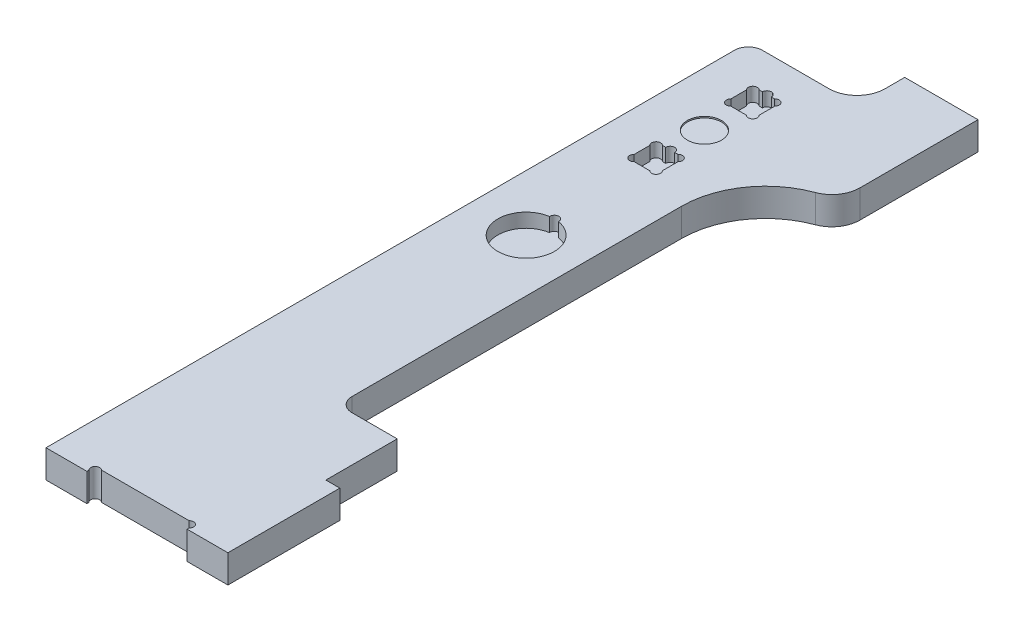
ISO-10303-21;
HEADER;
FILE_DESCRIPTION(('STEP AP214'),'2;1');
FILE_NAME('part.step','',(''),(''),'','','');
FILE_SCHEMA(('AUTOMOTIVE_DESIGN { 1 0 10303 214 1 1 1 1 }'));
ENDSEC;
DATA;
#1=APPLICATION_CONTEXT('core data for automotive mechanical design processes');
#2=APPLICATION_PROTOCOL_DEFINITION('international standard','automotive_design',2000,#1);
#3=PRODUCT_CONTEXT('',#1,'mechanical');
#4=PRODUCT('Part','Part','',(#3));
#5=PRODUCT_RELATED_PRODUCT_CATEGORY('part','',(#4));
#6=PRODUCT_DEFINITION_FORMATION('','',#4);
#7=PRODUCT_DEFINITION_CONTEXT('part definition',#1,'design');
#8=PRODUCT_DEFINITION('design','',#6,#7);
#9=PRODUCT_DEFINITION_SHAPE('','',#8);
#10=(LENGTH_UNIT() NAMED_UNIT(*) SI_UNIT(.MILLI.,.METRE.));
#11=(NAMED_UNIT(*) PLANE_ANGLE_UNIT() SI_UNIT($,.RADIAN.));
#12=(NAMED_UNIT(*) SI_UNIT($,.STERADIAN.) SOLID_ANGLE_UNIT());
#13=UNCERTAINTY_MEASURE_WITH_UNIT(LENGTH_MEASURE(1.E-05),#10,'distance_accuracy_value','');
#14=(GEOMETRIC_REPRESENTATION_CONTEXT(3) GLOBAL_UNCERTAINTY_ASSIGNED_CONTEXT((#13)) GLOBAL_UNIT_ASSIGNED_CONTEXT((#10,
#11,#12)) REPRESENTATION_CONTEXT('',''));
#15=CARTESIAN_POINT('',(0.,0.,0.));
#16=DIRECTION('',(0.,0.,1.));
#17=DIRECTION('',(1.,0.,0.));
#18=AXIS2_PLACEMENT_3D('',#15,#16,#17);
#19=CARTESIAN_POINT('',(-12.5,0.,-18.56));
#20=DIRECTION('',(0.,1.,0.));
#21=DIRECTION('',(0.,0.,1.));
#22=AXIS2_PLACEMENT_3D('',#19,#20,#21);
#23=CYLINDRICAL_SURFACE('',#22,10.1);
#24=CARTESIAN_POINT('',(-12.5,5.,-18.56));
#25=DIRECTION('',(0.,-1.,0.));
#26=DIRECTION('',(0.,0.,-1.));
#27=AXIS2_PLACEMENT_3D('',#24,#25,#26);
#28=CIRCLE('',#27,10.1);
#29=CARTESIAN_POINT('',(-14.0949729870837,5.,-28.5332673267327));
#30=VERTEX_POINT('',#29);
#31=CARTESIAN_POINT('',(-10.9050270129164,5.,-28.5332673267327));
#32=VERTEX_POINT('',#31);
#33=EDGE_CURVE('E419',#30,#32,#28,.F.);
#34=ORIENTED_EDGE('',*,*,#33,.F.);
#35=DIRECTION('',(0.,1.,0.));
#36=VECTOR('',#35,1.);
#37=CARTESIAN_POINT('',(-14.0949729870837,0.,-28.5332673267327));
#38=LINE('',#37,#36);
#39=CARTESIAN_POINT('',(-14.0949729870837,10.,-28.5332673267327));
#40=VERTEX_POINT('',#39);
#41=EDGE_CURVE('E612',#30,#40,#38,.T.);
#42=ORIENTED_EDGE('',*,*,#41,.T.);
#43=CARTESIAN_POINT('',(-12.5,10.,-18.56));
#44=DIRECTION('',(0.,1.,0.));
#45=DIRECTION('',(0.,0.,1.));
#46=AXIS2_PLACEMENT_3D('',#43,#44,#45);
#47=CIRCLE('',#46,10.1);
#48=CARTESIAN_POINT('',(-10.9050270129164,10.,-28.5332673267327));
#49=VERTEX_POINT('',#48);
#50=EDGE_CURVE('E603',#40,#49,#47,.T.);
#51=ORIENTED_EDGE('',*,*,#50,.T.);
#52=DIRECTION('',(0.,1.,0.));
#53=VECTOR('',#52,1.);
#54=CARTESIAN_POINT('',(-10.9050270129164,0.,-28.5332673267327));
#55=LINE('',#54,#53);
#56=EDGE_CURVE('E611',#32,#49,#55,.T.);
#57=ORIENTED_EDGE('',*,*,#56,.F.);
#58=EDGE_LOOP('',(#34,#42,#51,#57));
#59=FACE_BOUND('',#58,.T.);
#60=ADVANCED_FACE('F33',(#59),#23,.F.);
#61=CARTESIAN_POINT('',(-12.5,0.,-28.66));
#62=DIRECTION('',(0.,1.,0.));
#63=DIRECTION('',(0.,0.,1.));
#64=AXIS2_PLACEMENT_3D('',#61,#62,#63);
#65=CYLINDRICAL_SURFACE('',#64,1.60000000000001);
#66=CARTESIAN_POINT('',(-12.5,5.,-28.66));
#67=DIRECTION('',(0.,-1.,0.));
#68=DIRECTION('',(0.,0.,-1.));
#69=AXIS2_PLACEMENT_3D('',#66,#67,#68);
#70=CIRCLE('',#69,1.60000000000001);
#71=EDGE_CURVE('E416',#32,#30,#70,.F.);
#72=ORIENTED_EDGE('',*,*,#71,.F.);
#73=ORIENTED_EDGE('',*,*,#56,.T.);
#74=CARTESIAN_POINT('',(-12.5,10.,-28.66));
#75=DIRECTION('',(0.,1.,0.));
#76=DIRECTION('',(0.,0.,1.));
#77=AXIS2_PLACEMENT_3D('',#74,#75,#76);
#78=CIRCLE('',#77,1.60000000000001);
#79=EDGE_CURVE('E608',#49,#40,#78,.T.);
#80=ORIENTED_EDGE('',*,*,#79,.T.);
#81=ORIENTED_EDGE('',*,*,#41,.F.);
#82=EDGE_LOOP('',(#72,#73,#80,#81));
#83=FACE_BOUND('',#82,.T.);
#84=ADVANCED_FACE('F772',(#83),#65,.F.);
#85=CARTESIAN_POINT('',(-13.0420558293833,10.,-105.15187105));
#86=DIRECTION('',(0.,-1.,0.));
#87=DIRECTION('',(0.,0.,-1.));
#88=AXIS2_PLACEMENT_3D('',#85,#86,#87);
#89=CYLINDRICAL_SURFACE('',#88,1.6);
#90=CARTESIAN_POINT('',(-13.0420558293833,5.,-105.15187105));
#91=DIRECTION('',(0.,-1.,0.));
#92=DIRECTION('',(0.,0.,-1.));
#93=AXIS2_PLACEMENT_3D('',#90,#91,#92);
#94=CIRCLE('',#93,1.6);
#95=CARTESIAN_POINT('',(-11.4420558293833,5.,-105.15187105));
#96=VERTEX_POINT('',#95);
#97=CARTESIAN_POINT('',(-14.6420558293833,5.,-105.15187105));
#98=VERTEX_POINT('',#97);
#99=EDGE_CURVE('E413',#96,#98,#94,.F.);
#100=ORIENTED_EDGE('',*,*,#99,.F.);
#101=DIRECTION('',(0.,-1.,0.));
#102=VECTOR('',#101,1.);
#103=CARTESIAN_POINT('',(-11.4420558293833,10.,-105.15187105));
#104=LINE('',#103,#102);
#105=CARTESIAN_POINT('',(-11.4420558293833,10.,-105.15187105));
#106=VERTEX_POINT('',#105);
#107=EDGE_CURVE('E561',#106,#96,#104,.T.);
#108=ORIENTED_EDGE('',*,*,#107,.F.);
#109=CARTESIAN_POINT('',(-13.0420558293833,10.,-105.15187105));
#110=DIRECTION('',(0.,-1.,0.));
#111=DIRECTION('',(0.,0.,-1.));
#112=AXIS2_PLACEMENT_3D('',#109,#110,#111);
#113=CIRCLE('',#112,1.6);
#114=CARTESIAN_POINT('',(-14.6420558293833,10.,-105.15187105));
#115=VERTEX_POINT('',#114);
#116=EDGE_CURVE('E506',#115,#106,#113,.T.);
#117=ORIENTED_EDGE('',*,*,#116,.F.);
#118=DIRECTION('',(0.,-1.,0.));
#119=VECTOR('',#118,1.);
#120=CARTESIAN_POINT('',(-14.6420558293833,10.,-105.15187105));
#121=LINE('',#120,#119);
#122=EDGE_CURVE('E562',#115,#98,#121,.T.);
#123=ORIENTED_EDGE('',*,*,#122,.T.);
#124=EDGE_LOOP('',(#100,#108,#117,#123));
#125=FACE_BOUND('',#124,.T.);
#126=ADVANCED_FACE('F778',(#125),#89,.F.);
#127=CARTESIAN_POINT('',(-14.6420558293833,10.,-105.15187105));
#128=DIRECTION('',(0.,0.,-1.));
#129=DIRECTION('',(-1.,0.,0.));
#130=AXIS2_PLACEMENT_3D('',#127,#128,#129);
#131=PLANE('',#130);
#132=DIRECTION('',(-1.,0.,0.));
#133=VECTOR('',#132,1.);
#134=CARTESIAN_POINT('',(-14.6420558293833,5.,-105.15187105));
#135=LINE('',#134,#133);
#136=CARTESIAN_POINT('',(-15.8293141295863,5.,-105.15187105));
#137=VERTEX_POINT('',#136);
#138=EDGE_CURVE('E410',#98,#137,#135,.T.);
#139=ORIENTED_EDGE('',*,*,#138,.F.);
#140=ORIENTED_EDGE('',*,*,#122,.F.);
#141=DIRECTION('',(1.,0.,0.));
#142=VECTOR('',#141,1.);
#143=CARTESIAN_POINT('',(-14.6420558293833,10.,-105.15187105));
#144=LINE('',#143,#142);
#145=CARTESIAN_POINT('',(-15.8293141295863,10.,-105.15187105));
#146=VERTEX_POINT('',#145);
#147=EDGE_CURVE('E558',#146,#115,#144,.T.);
#148=ORIENTED_EDGE('',*,*,#147,.F.);
#149=DIRECTION('',(0.,-1.,0.));
#150=VECTOR('',#149,1.);
#151=CARTESIAN_POINT('',(-15.8293141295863,10.,-105.15187105));
#152=LINE('',#151,#150);
#153=EDGE_CURVE('E566',#146,#137,#152,.T.);
#154=ORIENTED_EDGE('',*,*,#153,.T.);
#155=EDGE_LOOP('',(#139,#140,#148,#154));
#156=FACE_BOUND('',#155,.T.);
#157=ADVANCED_FACE('F1125',(#156),#131,.F.);
#158=CARTESIAN_POINT('',(-16.9606849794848,10.,-104.020500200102));
#159=DIRECTION('',(0.,-1.,0.));
#160=DIRECTION('',(0.,0.,-1.));
#161=AXIS2_PLACEMENT_3D('',#158,#159,#160);
#162=CYLINDRICAL_SURFACE('',#161,1.6);
#163=CARTESIAN_POINT('',(-16.9606849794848,5.,-104.020500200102));
#164=DIRECTION('',(0.,-1.,0.));
#165=DIRECTION('',(0.,0.,-1.));
#166=AXIS2_PLACEMENT_3D('',#163,#164,#165);
#167=CIRCLE('',#166,1.6);
#168=CARTESIAN_POINT('',(-18.0920558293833,5.,-102.889129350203));
#169=VERTEX_POINT('',#168);
#170=EDGE_CURVE('E407',#137,#169,#167,.F.);
#171=ORIENTED_EDGE('',*,*,#170,.F.);
#172=ORIENTED_EDGE('',*,*,#153,.F.);
#173=CARTESIAN_POINT('',(-16.9606849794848,10.,-104.020500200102));
#174=DIRECTION('',(0.,-1.,0.));
#175=DIRECTION('',(0.,0.,-1.));
#176=AXIS2_PLACEMENT_3D('',#173,#174,#175);
#177=CIRCLE('',#176,1.6);
#178=CARTESIAN_POINT('',(-18.0920558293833,10.,-102.889129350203));
#179=VERTEX_POINT('',#178);
#180=EDGE_CURVE('E555',#179,#146,#177,.T.);
#181=ORIENTED_EDGE('',*,*,#180,.F.);
#182=DIRECTION('',(0.,-1.,0.));
#183=VECTOR('',#182,1.);
#184=CARTESIAN_POINT('',(-18.0920558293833,10.,-102.889129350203));
#185=LINE('',#184,#183);
#186=EDGE_CURVE('E569',#179,#169,#185,.T.);
#187=ORIENTED_EDGE('',*,*,#186,.T.);
#188=EDGE_LOOP('',(#171,#172,#181,#187));
#189=FACE_BOUND('',#188,.T.);
#190=ADVANCED_FACE('F1115',(#189),#162,.F.);
#191=CARTESIAN_POINT('',(-18.0920558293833,10.,-102.889129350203));
#192=DIRECTION('',(-1.,0.,0.));
#193=DIRECTION('',(0.,0.,1.));
#194=AXIS2_PLACEMENT_3D('',#191,#192,#193);
#195=PLANE('',#194);
#196=DIRECTION('',(0.,0.,1.));
#197=VECTOR('',#196,1.);
#198=CARTESIAN_POINT('',(-18.0920558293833,5.,-102.889129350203));
#199=LINE('',#198,#197);
#200=CARTESIAN_POINT('',(-18.0920558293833,5.,-97.314612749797));
#201=VERTEX_POINT('',#200);
#202=EDGE_CURVE('E404',#169,#201,#199,.T.);
#203=ORIENTED_EDGE('',*,*,#202,.F.);
#204=ORIENTED_EDGE('',*,*,#186,.F.);
#205=DIRECTION('',(0.,0.,-1.));
#206=VECTOR('',#205,1.);
#207=CARTESIAN_POINT('',(-18.0920558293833,10.,-102.889129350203));
#208=LINE('',#207,#206);
#209=CARTESIAN_POINT('',(-18.0920558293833,10.,-97.314612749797));
#210=VERTEX_POINT('',#209);
#211=EDGE_CURVE('E552',#210,#179,#208,.T.);
#212=ORIENTED_EDGE('',*,*,#211,.F.);
#213=DIRECTION('',(0.,-1.,0.));
#214=VECTOR('',#213,1.);
#215=CARTESIAN_POINT('',(-18.0920558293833,10.,-97.314612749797));
#216=LINE('',#215,#214);
#217=EDGE_CURVE('E572',#210,#201,#216,.T.);
#218=ORIENTED_EDGE('',*,*,#217,.T.);
#219=EDGE_LOOP('',(#203,#204,#212,#218));
#220=FACE_BOUND('',#219,.T.);
#221=ADVANCED_FACE('F1105',(#220),#195,.F.);
#222=CARTESIAN_POINT('',(-16.9606849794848,10.,-96.1832418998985));
#223=DIRECTION('',(0.,-1.,0.));
#224=DIRECTION('',(0.,0.,-1.));
#225=AXIS2_PLACEMENT_3D('',#222,#223,#224);
#226=CYLINDRICAL_SURFACE('',#225,1.6);
#227=CARTESIAN_POINT('',(-16.9606849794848,5.,-96.1832418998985));
#228=DIRECTION('',(0.,-1.,0.));
#229=DIRECTION('',(0.,0.,-1.));
#230=AXIS2_PLACEMENT_3D('',#227,#228,#229);
#231=CIRCLE('',#230,1.6);
#232=CARTESIAN_POINT('',(-15.8293141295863,5.,-95.05187105));
#233=VERTEX_POINT('',#232);
#234=EDGE_CURVE('E401',#201,#233,#231,.F.);
#235=ORIENTED_EDGE('',*,*,#234,.F.);
#236=ORIENTED_EDGE('',*,*,#217,.F.);
#237=CARTESIAN_POINT('',(-16.9606849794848,10.,-96.1832418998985));
#238=DIRECTION('',(0.,-1.,0.));
#239=DIRECTION('',(0.,0.,1.));
#240=AXIS2_PLACEMENT_3D('',#237,#238,#239);
#241=CIRCLE('',#240,1.6);
#242=CARTESIAN_POINT('',(-15.8293141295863,10.,-95.05187105));
#243=VERTEX_POINT('',#242);
#244=EDGE_CURVE('E549',#243,#210,#241,.T.);
#245=ORIENTED_EDGE('',*,*,#244,.F.);
#246=DIRECTION('',(0.,-1.,0.));
#247=VECTOR('',#246,1.);
#248=CARTESIAN_POINT('',(-15.8293141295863,10.,-95.05187105));
#249=LINE('',#248,#247);
#250=EDGE_CURVE('E575',#243,#233,#249,.T.);
#251=ORIENTED_EDGE('',*,*,#250,.T.);
#252=EDGE_LOOP('',(#235,#236,#245,#251));
#253=FACE_BOUND('',#252,.T.);
#254=ADVANCED_FACE('F1095',(#253),#226,.F.);
#255=CARTESIAN_POINT('',(-10.2547975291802,10.,-95.05187105));
#256=DIRECTION('',(0.,0.,1.));
#257=DIRECTION('',(1.,0.,0.));
#258=AXIS2_PLACEMENT_3D('',#255,#256,#257);
#259=PLANE('',#258);
#260=DIRECTION('',(1.,0.,0.));
#261=VECTOR('',#260,1.);
#262=CARTESIAN_POINT('',(-10.2547975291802,5.,-95.05187105));
#263=LINE('',#262,#261);
#264=CARTESIAN_POINT('',(-10.2547975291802,5.,-95.05187105));
#265=VERTEX_POINT('',#264);
#266=EDGE_CURVE('E398',#233,#265,#263,.T.);
#267=ORIENTED_EDGE('',*,*,#266,.F.);
#268=ORIENTED_EDGE('',*,*,#250,.F.);
#269=DIRECTION('',(-1.,0.,0.));
#270=VECTOR('',#269,1.);
#271=CARTESIAN_POINT('',(-10.2547975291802,10.,-95.05187105));
#272=LINE('',#271,#270);
#273=CARTESIAN_POINT('',(-10.2547975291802,10.,-95.05187105));
#274=VERTEX_POINT('',#273);
#275=EDGE_CURVE('E546',#274,#243,#272,.T.);
#276=ORIENTED_EDGE('',*,*,#275,.F.);
#277=DIRECTION('',(0.,-1.,0.));
#278=VECTOR('',#277,1.);
#279=CARTESIAN_POINT('',(-10.2547975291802,10.,-95.05187105));
#280=LINE('',#279,#278);
#281=EDGE_CURVE('E578',#274,#265,#280,.T.);
#282=ORIENTED_EDGE('',*,*,#281,.T.);
#283=EDGE_LOOP('',(#267,#268,#276,#282));
#284=FACE_BOUND('',#283,.T.);
#285=ADVANCED_FACE('F1085',(#284),#259,.F.);
#286=CARTESIAN_POINT('',(-9.12342667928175,10.,-96.1832418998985));
#287=DIRECTION('',(0.,-1.,0.));
#288=DIRECTION('',(0.,0.,-1.));
#289=AXIS2_PLACEMENT_3D('',#286,#287,#288);
#290=CYLINDRICAL_SURFACE('',#289,1.6);
#291=CARTESIAN_POINT('',(-9.12342667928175,5.,-96.1832418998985));
#292=DIRECTION('',(0.,-1.,0.));
#293=DIRECTION('',(0.,0.,-1.));
#294=AXIS2_PLACEMENT_3D('',#291,#292,#293);
#295=CIRCLE('',#294,1.6);
#296=CARTESIAN_POINT('',(-7.99205582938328,5.,-97.314612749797));
#297=VERTEX_POINT('',#296);
#298=EDGE_CURVE('E395',#265,#297,#295,.F.);
#299=ORIENTED_EDGE('',*,*,#298,.F.);
#300=ORIENTED_EDGE('',*,*,#281,.F.);
#301=CARTESIAN_POINT('',(-9.12342667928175,10.,-96.1832418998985));
#302=DIRECTION('',(0.,-1.,0.));
#303=DIRECTION('',(0.,0.,-1.));
#304=AXIS2_PLACEMENT_3D('',#301,#302,#303);
#305=CIRCLE('',#304,1.6);
#306=CARTESIAN_POINT('',(-7.99205582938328,10.,-97.314612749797));
#307=VERTEX_POINT('',#306);
#308=EDGE_CURVE('E543',#307,#274,#305,.T.);
#309=ORIENTED_EDGE('',*,*,#308,.F.);
#310=DIRECTION('',(0.,-1.,0.));
#311=VECTOR('',#310,1.);
#312=CARTESIAN_POINT('',(-7.99205582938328,10.,-97.314612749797));
#313=LINE('',#312,#311);
#314=EDGE_CURVE('E581',#307,#297,#313,.T.);
#315=ORIENTED_EDGE('',*,*,#314,.T.);
#316=EDGE_LOOP('',(#299,#300,#309,#315));
#317=FACE_BOUND('',#316,.T.);
#318=ADVANCED_FACE('F1075',(#317),#290,.F.);
#319=CARTESIAN_POINT('',(-7.99205582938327,10.,-102.889129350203));
#320=DIRECTION('',(1.,0.,0.));
#321=DIRECTION('',(0.,0.,-1.));
#322=AXIS2_PLACEMENT_3D('',#319,#320,#321);
#323=PLANE('',#322);
#324=DIRECTION('',(0.,0.,-1.));
#325=VECTOR('',#324,1.);
#326=CARTESIAN_POINT('',(-7.99205582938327,5.,-102.889129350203));
#327=LINE('',#326,#325);
#328=CARTESIAN_POINT('',(-7.99205582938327,5.,-102.889129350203));
#329=VERTEX_POINT('',#328);
#330=EDGE_CURVE('E392',#297,#329,#327,.T.);
#331=ORIENTED_EDGE('',*,*,#330,.F.);
#332=ORIENTED_EDGE('',*,*,#314,.F.);
#333=DIRECTION('',(0.,0.,1.));
#334=VECTOR('',#333,1.);
#335=CARTESIAN_POINT('',(-7.99205582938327,10.,-102.889129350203));
#336=LINE('',#335,#334);
#337=CARTESIAN_POINT('',(-7.99205582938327,10.,-102.889129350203));
#338=VERTEX_POINT('',#337);
#339=EDGE_CURVE('E540',#338,#307,#336,.T.);
#340=ORIENTED_EDGE('',*,*,#339,.F.);
#341=DIRECTION('',(0.,-1.,0.));
#342=VECTOR('',#341,1.);
#343=CARTESIAN_POINT('',(-7.99205582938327,10.,-102.889129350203));
#344=LINE('',#343,#342);
#345=EDGE_CURVE('E584',#338,#329,#344,.T.);
#346=ORIENTED_EDGE('',*,*,#345,.T.);
#347=EDGE_LOOP('',(#331,#332,#340,#346));
#348=FACE_BOUND('',#347,.T.);
#349=ADVANCED_FACE('F1065',(#348),#323,.F.);
#350=CARTESIAN_POINT('',(-9.12342667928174,10.,-104.020500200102));
#351=DIRECTION('',(0.,-1.,0.));
#352=DIRECTION('',(0.,0.,-1.));
#353=AXIS2_PLACEMENT_3D('',#350,#351,#352);
#354=CYLINDRICAL_SURFACE('',#353,1.6);
#355=CARTESIAN_POINT('',(-9.12342667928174,5.,-104.020500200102));
#356=DIRECTION('',(0.,-1.,0.));
#357=DIRECTION('',(0.,0.,-1.));
#358=AXIS2_PLACEMENT_3D('',#355,#356,#357);
#359=CIRCLE('',#358,1.6);
#360=CARTESIAN_POINT('',(-10.2547975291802,5.,-105.15187105));
#361=VERTEX_POINT('',#360);
#362=EDGE_CURVE('E389',#329,#361,#359,.F.);
#363=ORIENTED_EDGE('',*,*,#362,.F.);
#364=ORIENTED_EDGE('',*,*,#345,.F.);
#365=CARTESIAN_POINT('',(-9.12342667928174,10.,-104.020500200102));
#366=DIRECTION('',(0.,-1.,0.));
#367=DIRECTION('',(0.,0.,1.));
#368=AXIS2_PLACEMENT_3D('',#365,#366,#367);
#369=CIRCLE('',#368,1.6);
#370=CARTESIAN_POINT('',(-10.2547975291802,10.,-105.15187105));
#371=VERTEX_POINT('',#370);
#372=EDGE_CURVE('E537',#371,#338,#369,.T.);
#373=ORIENTED_EDGE('',*,*,#372,.F.);
#374=DIRECTION('',(0.,-1.,0.));
#375=VECTOR('',#374,1.);
#376=CARTESIAN_POINT('',(-10.2547975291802,10.,-105.15187105));
#377=LINE('',#376,#375);
#378=EDGE_CURVE('E587',#371,#361,#377,.T.);
#379=ORIENTED_EDGE('',*,*,#378,.T.);
#380=EDGE_LOOP('',(#363,#364,#373,#379));
#381=FACE_BOUND('',#380,.T.);
#382=ADVANCED_FACE('F1055',(#381),#354,.F.);
#383=CARTESIAN_POINT('',(-10.2547975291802,10.,-105.15187105));
#384=DIRECTION('',(0.,0.,-1.));
#385=DIRECTION('',(-1.,0.,0.));
#386=AXIS2_PLACEMENT_3D('',#383,#384,#385);
#387=PLANE('',#386);
#388=DIRECTION('',(-1.,0.,0.));
#389=VECTOR('',#388,1.);
#390=CARTESIAN_POINT('',(-10.2547975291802,5.,-105.15187105));
#391=LINE('',#390,#389);
#392=EDGE_CURVE('E386',#361,#96,#391,.T.);
#393=ORIENTED_EDGE('',*,*,#392,.F.);
#394=ORIENTED_EDGE('',*,*,#378,.F.);
#395=DIRECTION('',(1.,0.,0.));
#396=VECTOR('',#395,1.);
#397=CARTESIAN_POINT('',(-10.2547975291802,10.,-105.15187105));
#398=LINE('',#397,#396);
#399=EDGE_CURVE('E534',#106,#371,#398,.T.);
#400=ORIENTED_EDGE('',*,*,#399,.F.);
#401=ORIENTED_EDGE('',*,*,#107,.T.);
#402=EDGE_LOOP('',(#393,#394,#400,#401));
#403=FACE_BOUND('',#402,.T.);
#404=ADVANCED_FACE('F1045',(#403),#387,.F.);
#405=CARTESIAN_POINT('',(-17.0609744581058,10.,-69.5704950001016));
#406=DIRECTION('',(0.,-1.,0.));
#407=DIRECTION('',(0.,0.,-1.));
#408=AXIS2_PLACEMENT_3D('',#405,#406,#407);
#409=CYLINDRICAL_SURFACE('',#408,1.6);
#410=CARTESIAN_POINT('',(-17.0609744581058,5.,-69.5704950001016));
#411=DIRECTION('',(0.,-1.,0.));
#412=DIRECTION('',(0.,0.,-1.));
#413=AXIS2_PLACEMENT_3D('',#410,#411,#412);
#414=CIRCLE('',#413,1.6);
#415=CARTESIAN_POINT('',(-15.9296036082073,5.,-70.70186585));
#416=VERTEX_POINT('',#415);
#417=CARTESIAN_POINT('',(-18.1923453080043,5.,-68.4391241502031));
#418=VERTEX_POINT('',#417);
#419=EDGE_CURVE('E383',#416,#418,#414,.F.);
#420=ORIENTED_EDGE('',*,*,#419,.F.);
#421=DIRECTION('',(0.,-1.,0.));
#422=VECTOR('',#421,1.);
#423=CARTESIAN_POINT('',(-15.9296036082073,10.,-70.70186585));
#424=LINE('',#423,#422);
#425=CARTESIAN_POINT('',(-15.9296036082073,10.,-70.70186585));
#426=VERTEX_POINT('',#425);
#427=EDGE_CURVE('E502',#426,#416,#424,.T.);
#428=ORIENTED_EDGE('',*,*,#427,.F.);
#429=CARTESIAN_POINT('',(-17.0609744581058,10.,-69.5704950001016));
#430=DIRECTION('',(0.,-1.,0.));
#431=DIRECTION('',(0.,0.,1.));
#432=AXIS2_PLACEMENT_3D('',#429,#430,#431);
#433=CIRCLE('',#432,1.6);
#434=CARTESIAN_POINT('',(-18.1923453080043,10.,-68.4391241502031));
#435=VERTEX_POINT('',#434);
#436=EDGE_CURVE('E470',#435,#426,#433,.T.);
#437=ORIENTED_EDGE('',*,*,#436,.F.);
#438=DIRECTION('',(0.,-1.,0.));
#439=VECTOR('',#438,1.);
#440=CARTESIAN_POINT('',(-18.1923453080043,10.,-68.4391241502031));
#441=LINE('',#440,#439);
#442=EDGE_CURVE('E503',#435,#418,#441,.T.);
#443=ORIENTED_EDGE('',*,*,#442,.T.);
#444=EDGE_LOOP('',(#420,#428,#437,#443));
#445=FACE_BOUND('',#444,.T.);
#446=ADVANCED_FACE('F1035',(#445),#409,.F.);
#447=CARTESIAN_POINT('',(-18.1923453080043,10.,-68.4391241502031));
#448=DIRECTION('',(-1.,0.,0.));
#449=DIRECTION('',(0.,0.,1.));
#450=AXIS2_PLACEMENT_3D('',#447,#448,#449);
#451=PLANE('',#450);
#452=DIRECTION('',(0.,0.,1.));
#453=VECTOR('',#452,1.);
#454=CARTESIAN_POINT('',(-18.1923453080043,5.,-68.4391241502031));
#455=LINE('',#454,#453);
#456=CARTESIAN_POINT('',(-18.1923453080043,5.,-62.864607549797));
#457=VERTEX_POINT('',#456);
#458=EDGE_CURVE('E380',#418,#457,#455,.T.);
#459=ORIENTED_EDGE('',*,*,#458,.F.);
#460=ORIENTED_EDGE('',*,*,#442,.F.);
#461=DIRECTION('',(0.,0.,-1.));
#462=VECTOR('',#461,1.);
#463=CARTESIAN_POINT('',(-18.1923453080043,10.,-68.4391241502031));
#464=LINE('',#463,#462);
#465=CARTESIAN_POINT('',(-18.1923453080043,10.,-62.864607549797));
#466=VERTEX_POINT('',#465);
#467=EDGE_CURVE('E499',#466,#435,#464,.T.);
#468=ORIENTED_EDGE('',*,*,#467,.F.);
#469=DIRECTION('',(0.,-1.,0.));
#470=VECTOR('',#469,1.);
#471=CARTESIAN_POINT('',(-18.1923453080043,10.,-62.864607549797));
#472=LINE('',#471,#470);
#473=EDGE_CURVE('E507',#466,#457,#472,.T.);
#474=ORIENTED_EDGE('',*,*,#473,.T.);
#475=EDGE_LOOP('',(#459,#460,#468,#474));
#476=FACE_BOUND('',#475,.T.);
#477=ADVANCED_FACE('F1025',(#476),#451,.F.);
#478=CARTESIAN_POINT('',(-17.0609744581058,10.,-61.7332366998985));
#479=DIRECTION('',(0.,-1.,0.));
#480=DIRECTION('',(0.,0.,-1.));
#481=AXIS2_PLACEMENT_3D('',#478,#479,#480);
#482=CYLINDRICAL_SURFACE('',#481,1.6);
#483=CARTESIAN_POINT('',(-17.0609744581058,5.,-61.7332366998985));
#484=DIRECTION('',(0.,-1.,0.));
#485=DIRECTION('',(0.,0.,-1.));
#486=AXIS2_PLACEMENT_3D('',#483,#484,#485);
#487=CIRCLE('',#486,1.6);
#488=CARTESIAN_POINT('',(-15.9296036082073,5.,-60.60186585));
#489=VERTEX_POINT('',#488);
#490=EDGE_CURVE('E377',#457,#489,#487,.F.);
#491=ORIENTED_EDGE('',*,*,#490,.F.);
#492=ORIENTED_EDGE('',*,*,#473,.F.);
#493=CARTESIAN_POINT('',(-17.0609744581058,10.,-61.7332366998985));
#494=DIRECTION('',(0.,-1.,0.));
#495=DIRECTION('',(0.,0.,-1.));
#496=AXIS2_PLACEMENT_3D('',#493,#494,#495);
#497=CIRCLE('',#496,1.6);
#498=CARTESIAN_POINT('',(-15.9296036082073,10.,-60.60186585));
#499=VERTEX_POINT('',#498);
#500=EDGE_CURVE('E496',#499,#466,#497,.T.);
#501=ORIENTED_EDGE('',*,*,#500,.F.);
#502=DIRECTION('',(0.,-1.,0.));
#503=VECTOR('',#502,1.);
#504=CARTESIAN_POINT('',(-15.9296036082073,10.,-60.60186585));
#505=LINE('',#504,#503);
#506=EDGE_CURVE('E510',#499,#489,#505,.T.);
#507=ORIENTED_EDGE('',*,*,#506,.T.);
#508=EDGE_LOOP('',(#491,#492,#501,#507));
#509=FACE_BOUND('',#508,.T.);
#510=ADVANCED_FACE('F1015',(#509),#482,.F.);
#511=CARTESIAN_POINT('',(-10.3547975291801,10.,-60.60186585));
#512=DIRECTION('',(0.,0.,1.));
#513=DIRECTION('',(1.,0.,0.));
#514=AXIS2_PLACEMENT_3D('',#511,#512,#513);
#515=PLANE('',#514);
#516=DIRECTION('',(1.,0.,0.));
#517=VECTOR('',#516,1.);
#518=CARTESIAN_POINT('',(-10.3547975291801,5.,-60.60186585));
#519=LINE('',#518,#517);
#520=CARTESIAN_POINT('',(-10.3547975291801,5.,-60.60186585));
#521=VERTEX_POINT('',#520);
#522=EDGE_CURVE('E374',#489,#521,#519,.T.);
#523=ORIENTED_EDGE('',*,*,#522,.F.);
#524=ORIENTED_EDGE('',*,*,#506,.F.);
#525=DIRECTION('',(-1.,0.,0.));
#526=VECTOR('',#525,1.);
#527=CARTESIAN_POINT('',(-10.3547975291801,10.,-60.60186585));
#528=LINE('',#527,#526);
#529=CARTESIAN_POINT('',(-10.3547975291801,10.,-60.60186585));
#530=VERTEX_POINT('',#529);
#531=EDGE_CURVE('E493',#530,#499,#528,.T.);
#532=ORIENTED_EDGE('',*,*,#531,.F.);
#533=DIRECTION('',(0.,-1.,0.));
#534=VECTOR('',#533,1.);
#535=CARTESIAN_POINT('',(-10.3547975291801,10.,-60.60186585));
#536=LINE('',#535,#534);
#537=EDGE_CURVE('E513',#530,#521,#536,.T.);
#538=ORIENTED_EDGE('',*,*,#537,.T.);
#539=EDGE_LOOP('',(#523,#524,#532,#538));
#540=FACE_BOUND('',#539,.T.);
#541=ADVANCED_FACE('F1005',(#540),#515,.F.);
#542=CARTESIAN_POINT('',(-9.22342667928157,10.,-61.7332366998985));
#543=DIRECTION('',(0.,-1.,0.));
#544=DIRECTION('',(0.,0.,-1.));
#545=AXIS2_PLACEMENT_3D('',#542,#543,#544);
#546=CYLINDRICAL_SURFACE('',#545,1.6);
#547=CARTESIAN_POINT('',(-9.22342667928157,5.,-61.7332366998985));
#548=DIRECTION('',(0.,-1.,0.));
#549=DIRECTION('',(0.,0.,-1.));
#550=AXIS2_PLACEMENT_3D('',#547,#548,#549);
#551=CIRCLE('',#550,1.6);
#552=CARTESIAN_POINT('',(-8.09205582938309,5.,-62.864607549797));
#553=VERTEX_POINT('',#552);
#554=EDGE_CURVE('E371',#521,#553,#551,.F.);
#555=ORIENTED_EDGE('',*,*,#554,.F.);
#556=ORIENTED_EDGE('',*,*,#537,.F.);
#557=CARTESIAN_POINT('',(-9.22342667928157,10.,-61.7332366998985));
#558=DIRECTION('',(0.,-1.,0.));
#559=DIRECTION('',(0.,0.,1.));
#560=AXIS2_PLACEMENT_3D('',#557,#558,#559);
#561=CIRCLE('',#560,1.6);
#562=CARTESIAN_POINT('',(-8.09205582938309,10.,-62.864607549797));
#563=VERTEX_POINT('',#562);
#564=EDGE_CURVE('E490',#563,#530,#561,.T.);
#565=ORIENTED_EDGE('',*,*,#564,.F.);
#566=DIRECTION('',(0.,-1.,0.));
#567=VECTOR('',#566,1.);
#568=CARTESIAN_POINT('',(-8.09205582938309,10.,-62.864607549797));
#569=LINE('',#568,#567);
#570=EDGE_CURVE('E516',#563,#553,#569,.T.);
#571=ORIENTED_EDGE('',*,*,#570,.T.);
#572=EDGE_LOOP('',(#555,#556,#565,#571));
#573=FACE_BOUND('',#572,.T.);
#574=ADVANCED_FACE('F995',(#573),#546,.F.);
#575=CARTESIAN_POINT('',(-8.09205582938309,10.,-68.4391241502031));
#576=DIRECTION('',(1.,0.,0.));
#577=DIRECTION('',(0.,0.,-1.));
#578=AXIS2_PLACEMENT_3D('',#575,#576,#577);
#579=PLANE('',#578);
#580=DIRECTION('',(0.,0.,-1.));
#581=VECTOR('',#580,1.);
#582=CARTESIAN_POINT('',(-8.09205582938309,5.,-68.4391241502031));
#583=LINE('',#582,#581);
#584=CARTESIAN_POINT('',(-8.09205582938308,5.,-68.4391241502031));
#585=VERTEX_POINT('',#584);
#586=EDGE_CURVE('E368',#553,#585,#583,.T.);
#587=ORIENTED_EDGE('',*,*,#586,.F.);
#588=ORIENTED_EDGE('',*,*,#570,.F.);
#589=DIRECTION('',(0.,0.,1.));
#590=VECTOR('',#589,1.);
#591=CARTESIAN_POINT('',(-8.09205582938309,10.,-68.4391241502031));
#592=LINE('',#591,#590);
#593=CARTESIAN_POINT('',(-8.09205582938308,10.,-68.4391241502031));
#594=VERTEX_POINT('',#593);
#595=EDGE_CURVE('E487',#594,#563,#592,.T.);
#596=ORIENTED_EDGE('',*,*,#595,.F.);
#597=DIRECTION('',(0.,-1.,0.));
#598=VECTOR('',#597,1.);
#599=CARTESIAN_POINT('',(-8.09205582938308,10.,-68.4391241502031));
#600=LINE('',#599,#598);
#601=EDGE_CURVE('E519',#594,#585,#600,.T.);
#602=ORIENTED_EDGE('',*,*,#601,.T.);
#603=EDGE_LOOP('',(#587,#588,#596,#602));
#604=FACE_BOUND('',#603,.T.);
#605=ADVANCED_FACE('F985',(#604),#579,.F.);
#606=CARTESIAN_POINT('',(-9.22342667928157,10.,-69.5704950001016));
#607=DIRECTION('',(0.,-1.,0.));
#608=DIRECTION('',(0.,0.,-1.));
#609=AXIS2_PLACEMENT_3D('',#606,#607,#608);
#610=CYLINDRICAL_SURFACE('',#609,1.6);
#611=CARTESIAN_POINT('',(-9.22342667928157,5.,-69.5704950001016));
#612=DIRECTION('',(0.,-1.,0.));
#613=DIRECTION('',(0.,0.,-1.));
#614=AXIS2_PLACEMENT_3D('',#611,#612,#613);
#615=CIRCLE('',#614,1.6);
#616=CARTESIAN_POINT('',(-10.3547975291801,5.,-70.70186585));
#617=VERTEX_POINT('',#616);
#618=EDGE_CURVE('E365',#585,#617,#615,.F.);
#619=ORIENTED_EDGE('',*,*,#618,.F.);
#620=ORIENTED_EDGE('',*,*,#601,.F.);
#621=CARTESIAN_POINT('',(-9.22342667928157,10.,-69.5704950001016));
#622=DIRECTION('',(0.,-1.,0.));
#623=DIRECTION('',(0.,0.,-1.));
#624=AXIS2_PLACEMENT_3D('',#621,#622,#623);
#625=CIRCLE('',#624,1.6);
#626=CARTESIAN_POINT('',(-10.3547975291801,10.,-70.70186585));
#627=VERTEX_POINT('',#626);
#628=EDGE_CURVE('E484',#627,#594,#625,.T.);
#629=ORIENTED_EDGE('',*,*,#628,.F.);
#630=DIRECTION('',(0.,-1.,0.));
#631=VECTOR('',#630,1.);
#632=CARTESIAN_POINT('',(-10.3547975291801,10.,-70.70186585));
#633=LINE('',#632,#631);
#634=EDGE_CURVE('E522',#627,#617,#633,.T.);
#635=ORIENTED_EDGE('',*,*,#634,.T.);
#636=EDGE_LOOP('',(#619,#620,#629,#635));
#637=FACE_BOUND('',#636,.T.);
#638=ADVANCED_FACE('F975',(#637),#610,.F.);
#639=CARTESIAN_POINT('',(-10.3547975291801,10.,-70.70186585));
#640=DIRECTION('',(0.,0.,-1.));
#641=DIRECTION('',(-1.,0.,0.));
#642=AXIS2_PLACEMENT_3D('',#639,#640,#641);
#643=PLANE('',#642);
#644=DIRECTION('',(-1.,0.,0.));
#645=VECTOR('',#644,1.);
#646=CARTESIAN_POINT('',(-10.3547975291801,5.,-70.70186585));
#647=LINE('',#646,#645);
#648=CARTESIAN_POINT('',(-11.5422005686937,5.,-70.70186585));
#649=VERTEX_POINT('',#648);
#650=EDGE_CURVE('E362',#617,#649,#647,.T.);
#651=ORIENTED_EDGE('',*,*,#650,.F.);
#652=ORIENTED_EDGE('',*,*,#634,.F.);
#653=DIRECTION('',(1.,0.,0.));
#654=VECTOR('',#653,1.);
#655=CARTESIAN_POINT('',(-10.3547975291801,10.,-70.70186585));
#656=LINE('',#655,#654);
#657=CARTESIAN_POINT('',(-11.5422005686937,10.,-70.70186585));
#658=VERTEX_POINT('',#657);
#659=EDGE_CURVE('E481',#658,#627,#656,.T.);
#660=ORIENTED_EDGE('',*,*,#659,.F.);
#661=DIRECTION('',(0.,-1.,0.));
#662=VECTOR('',#661,1.);
#663=CARTESIAN_POINT('',(-11.5422005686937,10.,-70.70186585));
#664=LINE('',#663,#662);
#665=EDGE_CURVE('E525',#658,#649,#664,.T.);
#666=ORIENTED_EDGE('',*,*,#665,.T.);
#667=EDGE_LOOP('',(#651,#652,#660,#666));
#668=FACE_BOUND('',#667,.T.);
#669=ADVANCED_FACE('F965',(#668),#643,.F.);
#670=CARTESIAN_POINT('',(-13.1422005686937,10.,-70.70186585));
#671=DIRECTION('',(0.,-1.,0.));
#672=DIRECTION('',(0.,0.,-1.));
#673=AXIS2_PLACEMENT_3D('',#670,#671,#672);
#674=CYLINDRICAL_SURFACE('',#673,1.6);
#675=CARTESIAN_POINT('',(-13.1422005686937,5.,-70.70186585));
#676=DIRECTION('',(0.,-1.,0.));
#677=DIRECTION('',(0.,0.,-1.));
#678=AXIS2_PLACEMENT_3D('',#675,#676,#677);
#679=CIRCLE('',#678,1.6);
#680=CARTESIAN_POINT('',(-14.7422005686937,5.,-70.70186585));
#681=VERTEX_POINT('',#680);
#682=EDGE_CURVE('E357',#649,#681,#679,.F.);
#683=ORIENTED_EDGE('',*,*,#682,.F.);
#684=ORIENTED_EDGE('',*,*,#665,.F.);
#685=CARTESIAN_POINT('',(-13.1422005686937,10.,-70.70186585));
#686=DIRECTION('',(0.,-1.,0.));
#687=DIRECTION('',(0.,0.,-1.));
#688=AXIS2_PLACEMENT_3D('',#685,#686,#687);
#689=CIRCLE('',#688,1.6);
#690=CARTESIAN_POINT('',(-14.7422005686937,10.,-70.70186585));
#691=VERTEX_POINT('',#690);
#692=EDGE_CURVE('E478',#691,#658,#689,.T.);
#693=ORIENTED_EDGE('',*,*,#692,.F.);
#694=DIRECTION('',(0.,-1.,0.));
#695=VECTOR('',#694,1.);
#696=CARTESIAN_POINT('',(-14.7422005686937,10.,-70.70186585));
#697=LINE('',#696,#695);
#698=EDGE_CURVE('E528',#691,#681,#697,.T.);
#699=ORIENTED_EDGE('',*,*,#698,.T.);
#700=EDGE_LOOP('',(#683,#684,#693,#699));
#701=FACE_BOUND('',#700,.T.);
#702=ADVANCED_FACE('F953',(#701),#674,.F.);
#703=CARTESIAN_POINT('',(-14.7422005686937,10.,-70.70186585));
#704=DIRECTION('',(0.,0.,-1.));
#705=DIRECTION('',(-1.,0.,0.));
#706=AXIS2_PLACEMENT_3D('',#703,#704,#705);
#707=PLANE('',#706);
#708=DIRECTION('',(-1.,0.,0.));
#709=VECTOR('',#708,1.);
#710=CARTESIAN_POINT('',(-14.7422005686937,5.,-70.70186585));
#711=LINE('',#710,#709);
#712=EDGE_CURVE('E642',#681,#416,#711,.T.);
#713=ORIENTED_EDGE('',*,*,#712,.F.);
#714=ORIENTED_EDGE('',*,*,#698,.F.);
#715=DIRECTION('',(1.,0.,0.));
#716=VECTOR('',#715,1.);
#717=CARTESIAN_POINT('',(-14.7422005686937,10.,-70.70186585));
#718=LINE('',#717,#716);
#719=EDGE_CURVE('E475',#426,#691,#718,.T.);
#720=ORIENTED_EDGE('',*,*,#719,.F.);
#721=ORIENTED_EDGE('',*,*,#427,.T.);
#722=EDGE_LOOP('',(#713,#714,#720,#721));
#723=FACE_BOUND('',#722,.T.);
#724=ADVANCED_FACE('F948',(#723),#707,.F.);
#725=CARTESIAN_POINT('',(-32.5,10.,133.));
#726=DIRECTION('',(0.,0.,-1.));
#727=DIRECTION('',(-1.,0.,0.));
#728=AXIS2_PLACEMENT_3D('',#725,#726,#727);
#729=PLANE('',#728);
#730=DIRECTION('',(1.,0.,0.));
#731=VECTOR('',#730,1.);
#732=CARTESIAN_POINT('',(-32.5,0.,133.));
#733=LINE('',#732,#731);
#734=CARTESIAN_POINT('',(-32.5,0.,133.));
#735=VERTEX_POINT('',#734);
#736=CARTESIAN_POINT('',(-17.91,0.,133.));
#737=VERTEX_POINT('',#736);
#738=EDGE_CURVE('E630',#735,#737,#733,.T.);
#739=ORIENTED_EDGE('',*,*,#738,.T.);
#740=DIRECTION('',(0.,1.,0.));
#741=VECTOR('',#740,1.);
#742=CARTESIAN_POINT('',(-17.91,0.,133.));
#743=LINE('',#742,#741);
#744=CARTESIAN_POINT('',(-17.91,10.,133.));
#745=VERTEX_POINT('',#744);
#746=EDGE_CURVE('E439',#737,#745,#743,.T.);
#747=ORIENTED_EDGE('',*,*,#746,.T.);
#748=DIRECTION('',(1.,0.,0.));
#749=VECTOR('',#748,1.);
#750=CARTESIAN_POINT('',(-32.5,10.,133.));
#751=LINE('',#750,#749);
#752=CARTESIAN_POINT('',(-32.5,10.,133.));
#753=VERTEX_POINT('',#752);
#754=EDGE_CURVE('E621',#753,#745,#751,.T.);
#755=ORIENTED_EDGE('',*,*,#754,.F.);
#756=DIRECTION('',(0.,-1.,0.));
#757=VECTOR('',#756,1.);
#758=CARTESIAN_POINT('',(-32.5,10.,133.));
#759=LINE('',#758,#757);
#760=EDGE_CURVE('E634',#753,#735,#759,.T.);
#761=ORIENTED_EDGE('',*,*,#760,.T.);
#762=EDGE_LOOP('',(#739,#747,#755,#761));
#763=FACE_BOUND('',#762,.T.);
#764=ADVANCED_FACE('F702',(#763),#729,.F.);
#765=CARTESIAN_POINT('',(32.5,10.,-133.));
#766=DIRECTION('',(1.,0.,0.));
#767=DIRECTION('',(0.,0.,-1.));
#768=AXIS2_PLACEMENT_3D('',#765,#766,#767);
#769=PLANE('',#768);
#770=DIRECTION('',(0.,1.,0.));
#771=VECTOR('',#770,1.);
#772=CARTESIAN_POINT('',(32.5,0.,93.));
#773=LINE('',#772,#771);
#774=CARTESIAN_POINT('',(32.5,0.,93.));
#775=VERTEX_POINT('',#774);
#776=CARTESIAN_POINT('',(32.5,10.,93.));
#777=VERTEX_POINT('',#776);
#778=EDGE_CURVE('E600',#775,#777,#773,.T.);
#779=ORIENTED_EDGE('',*,*,#778,.T.);
#780=DIRECTION('',(0.,0.,1.));
#781=VECTOR('',#780,1.);
#782=CARTESIAN_POINT('',(32.5,10.,-133.));
#783=LINE('',#782,#781);
#784=CARTESIAN_POINT('',(32.5,10.,133.));
#785=VERTEX_POINT('',#784);
#786=EDGE_CURVE('E616',#777,#785,#783,.T.);
#787=ORIENTED_EDGE('',*,*,#786,.T.);
#788=DIRECTION('',(0.,-1.,0.));
#789=VECTOR('',#788,1.);
#790=CARTESIAN_POINT('',(32.5,10.,133.));
#791=LINE('',#790,#789);
#792=CARTESIAN_POINT('',(32.5,0.,133.));
#793=VERTEX_POINT('',#792);
#794=EDGE_CURVE('E626',#785,#793,#791,.T.);
#795=ORIENTED_EDGE('',*,*,#794,.T.);
#796=DIRECTION('',(0.,0.,1.));
#797=VECTOR('',#796,1.);
#798=CARTESIAN_POINT('',(32.5,0.,-133.));
#799=LINE('',#798,#797);
#800=EDGE_CURVE('E614',#775,#793,#799,.T.);
#801=ORIENTED_EDGE('',*,*,#800,.F.);
#802=EDGE_LOOP('',(#779,#787,#795,#801));
#803=FACE_BOUND('',#802,.T.);
#804=ADVANCED_FACE('F731',(#803),#769,.T.);
#805=CARTESIAN_POINT('',(-32.5,10.,-133.));
#806=DIRECTION('',(1.,0.,0.));
#807=DIRECTION('',(0.,0.,-1.));
#808=AXIS2_PLACEMENT_3D('',#805,#806,#807);
#809=PLANE('',#808);
#810=DIRECTION('',(0.,0.,1.));
#811=VECTOR('',#810,1.);
#812=CARTESIAN_POINT('',(-32.5,10.,-133.));
#813=LINE('',#812,#811);
#814=CARTESIAN_POINT('',(-32.5,10.,-113.));
#815=VERTEX_POINT('',#814);
#816=EDGE_CURVE('E624',#815,#753,#813,.T.);
#817=ORIENTED_EDGE('',*,*,#816,.F.);
#818=DIRECTION('',(0.,1.,0.));
#819=VECTOR('',#818,1.);
#820=CARTESIAN_POINT('',(-32.5,10.,-113.));
#821=LINE('',#820,#819);
#822=CARTESIAN_POINT('',(-32.5,0.,-113.));
#823=VERTEX_POINT('',#822);
#824=EDGE_CURVE('E656',#815,#823,#821,.F.);
#825=ORIENTED_EDGE('',*,*,#824,.T.);
#826=DIRECTION('',(0.,0.,1.));
#827=VECTOR('',#826,1.);
#828=CARTESIAN_POINT('',(-32.5,0.,-133.));
#829=LINE('',#828,#827);
#830=EDGE_CURVE('E620',#823,#735,#829,.T.);
#831=ORIENTED_EDGE('',*,*,#830,.T.);
#832=ORIENTED_EDGE('',*,*,#760,.F.);
#833=EDGE_LOOP('',(#817,#825,#831,#832));
#834=FACE_BOUND('',#833,.T.);
#835=ADVANCED_FACE('F698',(#834),#809,.F.);
#836=CARTESIAN_POINT('',(17.91,10.,133.));
#837=VERTEX_POINT('',#836);
#838=EDGE_CURVE('E619',#837,#785,#751,.T.);
#839=ORIENTED_EDGE('',*,*,#838,.F.);
#840=DIRECTION('',(0.,1.,0.));
#841=VECTOR('',#840,1.);
#842=CARTESIAN_POINT('',(17.91,0.,133.));
#843=LINE('',#842,#841);
#844=CARTESIAN_POINT('',(17.91,0.,133.));
#845=VERTEX_POINT('',#844);
#846=EDGE_CURVE('E461',#845,#837,#843,.T.);
#847=ORIENTED_EDGE('',*,*,#846,.F.);
#848=EDGE_CURVE('E629',#845,#793,#733,.T.);
#849=ORIENTED_EDGE('',*,*,#848,.T.);
#850=ORIENTED_EDGE('',*,*,#794,.F.);
#851=EDGE_LOOP('',(#839,#847,#849,#850));
#852=FACE_BOUND('',#851,.T.);
#853=ADVANCED_FACE('F726',(#852),#729,.F.);
#854=CARTESIAN_POINT('',(0.,10.,0.));
#855=DIRECTION('',(0.,-1.,0.));
#856=DIRECTION('',(0.,0.,-1.));
#857=AXIS2_PLACEMENT_3D('',#854,#855,#856);
#858=PLANE('',#857);
#859=CARTESIAN_POINT('',(-13.0921281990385,10.,-82.87686845));
#860=DIRECTION('',(0.,1.,0.));
#861=DIRECTION('',(0.,0.,1.));
#862=AXIS2_PLACEMENT_3D('',#859,#860,#861);
#863=CIRCLE('',#862,6.09999999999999);
#864=CARTESIAN_POINT('',(-13.0921281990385,10.,-76.77686845));
#865=VERTEX_POINT('',#864);
#866=EDGE_CURVE('E351',#865,#865,#863,.T.);
#867=ORIENTED_EDGE('',*,*,#866,.F.);
#868=EDGE_LOOP('',(#867));
#869=FACE_BOUND('',#868,.T.);
#870=ORIENTED_EDGE('',*,*,#467,.T.);
#871=ORIENTED_EDGE('',*,*,#436,.T.);
#872=ORIENTED_EDGE('',*,*,#719,.T.);
#873=ORIENTED_EDGE('',*,*,#692,.T.);
#874=ORIENTED_EDGE('',*,*,#659,.T.);
#875=ORIENTED_EDGE('',*,*,#628,.T.);
#876=ORIENTED_EDGE('',*,*,#595,.T.);
#877=ORIENTED_EDGE('',*,*,#564,.T.);
#878=ORIENTED_EDGE('',*,*,#531,.T.);
#879=ORIENTED_EDGE('',*,*,#500,.T.);
#880=EDGE_LOOP('',(#870,#871,#872,#873,#874,#875,#876,#877,#878,#879));
#881=FACE_BOUND('',#880,.T.);
#882=ORIENTED_EDGE('',*,*,#147,.T.);
#883=ORIENTED_EDGE('',*,*,#116,.T.);
#884=ORIENTED_EDGE('',*,*,#399,.T.);
#885=ORIENTED_EDGE('',*,*,#372,.T.);
#886=ORIENTED_EDGE('',*,*,#339,.T.);
#887=ORIENTED_EDGE('',*,*,#308,.T.);
#888=ORIENTED_EDGE('',*,*,#275,.T.);
#889=ORIENTED_EDGE('',*,*,#244,.T.);
#890=ORIENTED_EDGE('',*,*,#211,.T.);
#891=ORIENTED_EDGE('',*,*,#180,.T.);
#892=EDGE_LOOP('',(#882,#883,#884,#885,#886,#887,#888,#889,#890,#891));
#893=FACE_BOUND('',#892,.T.);
#894=ORIENTED_EDGE('',*,*,#79,.F.);
#895=ORIENTED_EDGE('',*,*,#50,.F.);
#896=EDGE_LOOP('',(#894,#895));
#897=FACE_BOUND('',#896,.T.);
#898=CARTESIAN_POINT('',(36.3179441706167,10.,-55.2839367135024));
#899=DIRECTION('',(0.,-1.,0.));
#900=DIRECTION('',(0.,0.,-1.));
#901=AXIS2_PLACEMENT_3D('',#898,#899,#900);
#902=CIRCLE('',#901,30.);
#903=CARTESIAN_POINT('',(6.31794417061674,10.,-55.2839367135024));
#904=VERTEX_POINT('',#903);
#905=CARTESIAN_POINT('',(25.9544860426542,10.,-83.4370668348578));
#906=VERTEX_POINT('',#905);
#907=EDGE_CURVE('E669',#904,#906,#902,.T.);
#908=ORIENTED_EDGE('',*,*,#907,.T.);
#909=CARTESIAN_POINT('',(22.5,10.,-92.8214435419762));
#910=DIRECTION('',(0.,-1.,0.));
#911=DIRECTION('',(0.,0.,-1.));
#912=AXIS2_PLACEMENT_3D('',#909,#910,#911);
#913=CIRCLE('',#912,10.);
#914=CARTESIAN_POINT('',(32.5,10.,-92.8214435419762));
#915=VERTEX_POINT('',#914);
#916=EDGE_CURVE('E679',#906,#915,#913,.F.);
#917=ORIENTED_EDGE('',*,*,#916,.T.);
#918=DIRECTION('',(0.,0.,1.));
#919=VECTOR('',#918,1.);
#920=CARTESIAN_POINT('',(32.5,10.,-85.04));
#921=LINE('',#920,#919);
#922=CARTESIAN_POINT('',(32.5,10.,-135.04));
#923=VERTEX_POINT('',#922);
#924=EDGE_CURVE('E334',#923,#915,#921,.T.);
#925=ORIENTED_EDGE('',*,*,#924,.F.);
#926=DIRECTION('',(1.,0.,0.));
#927=VECTOR('',#926,1.);
#928=CARTESIAN_POINT('',(6.31794417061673,10.,-135.04));
#929=LINE('',#928,#927);
#930=CARTESIAN_POINT('',(6.31794417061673,10.,-135.04));
#931=VERTEX_POINT('',#930);
#932=EDGE_CURVE('E325',#931,#923,#929,.T.);
#933=ORIENTED_EDGE('',*,*,#932,.F.);
#934=DIRECTION('',(0.,0.,-1.));
#935=VECTOR('',#934,1.);
#936=CARTESIAN_POINT('',(6.31794417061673,10.,-85.04));
#937=LINE('',#936,#935);
#938=CARTESIAN_POINT('',(6.31794417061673,10.,-128.));
#939=VERTEX_POINT('',#938);
#940=EDGE_CURVE('E315',#939,#931,#937,.T.);
#941=ORIENTED_EDGE('',*,*,#940,.F.);
#942=CARTESIAN_POINT('',(-3.68205582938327,10.,-128.));
#943=DIRECTION('',(0.,-1.,0.));
#944=DIRECTION('',(0.,0.,-1.));
#945=AXIS2_PLACEMENT_3D('',#942,#943,#944);
#946=CIRCLE('',#945,10.);
#947=CARTESIAN_POINT('',(-3.68205582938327,10.,-118.));
#948=VERTEX_POINT('',#947);
#949=EDGE_CURVE('E41',#939,#948,#946,.T.);
#950=ORIENTED_EDGE('',*,*,#949,.T.);
#951=DIRECTION('',(1.,0.,0.));
#952=VECTOR('',#951,1.);
#953=CARTESIAN_POINT('',(-32.5,10.,-118.));
#954=LINE('',#953,#952);
#955=CARTESIAN_POINT('',(-27.5,10.,-118.));
#956=VERTEX_POINT('',#955);
#957=EDGE_CURVE('E346',#956,#948,#954,.T.);
#958=ORIENTED_EDGE('',*,*,#957,.F.);
#959=CARTESIAN_POINT('',(-27.5,10.,-113.));
#960=DIRECTION('',(0.,-1.,0.));
#961=DIRECTION('',(0.,0.,-1.));
#962=AXIS2_PLACEMENT_3D('',#959,#960,#961);
#963=CIRCLE('',#962,5.);
#964=EDGE_CURVE('E654',#956,#815,#963,.F.);
#965=ORIENTED_EDGE('',*,*,#964,.T.);
#966=ORIENTED_EDGE('',*,*,#816,.T.);
#967=ORIENTED_EDGE('',*,*,#754,.T.);
#968=DIRECTION('',(0.,0.,1.));
#969=VECTOR('',#968,1.);
#970=CARTESIAN_POINT('',(-17.91,10.,133.));
#971=LINE('',#970,#969);
#972=CARTESIAN_POINT('',(-17.91,10.,132.262741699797));
#973=VERTEX_POINT('',#972);
#974=EDGE_CURVE('E422',#973,#745,#971,.T.);
#975=ORIENTED_EDGE('',*,*,#974,.F.);
#976=CARTESIAN_POINT('',(-16.7786291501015,10.,131.131370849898));
#977=DIRECTION('',(0.,1.,0.));
#978=DIRECTION('',(0.,0.,-1.));
#979=AXIS2_PLACEMENT_3D('',#976,#977,#978);
#980=CIRCLE('',#979,1.60000000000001);
#981=CARTESIAN_POINT('',(-15.647258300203,10.,130.));
#982=VERTEX_POINT('',#981);
#983=EDGE_CURVE('E427',#982,#973,#980,.T.);
#984=ORIENTED_EDGE('',*,*,#983,.F.);
#985=DIRECTION('',(-1.,0.,0.));
#986=VECTOR('',#985,1.);
#987=CARTESIAN_POINT('',(-15.647258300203,10.,130.));
#988=LINE('',#987,#986);
#989=CARTESIAN_POINT('',(15.647258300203,10.,130.));
#990=VERTEX_POINT('',#989);
#991=EDGE_CURVE('E447',#990,#982,#988,.T.);
#992=ORIENTED_EDGE('',*,*,#991,.F.);
#993=CARTESIAN_POINT('',(16.7786291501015,10.,131.131370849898));
#994=DIRECTION('',(0.,1.,0.));
#995=DIRECTION('',(0.,0.,1.));
#996=AXIS2_PLACEMENT_3D('',#993,#994,#995);
#997=CIRCLE('',#996,1.60000000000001);
#998=CARTESIAN_POINT('',(17.91,10.,132.262741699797));
#999=VERTEX_POINT('',#998);
#1000=EDGE_CURVE('E444',#999,#990,#997,.T.);
#1001=ORIENTED_EDGE('',*,*,#1000,.F.);
#1002=DIRECTION('',(0.,0.,-1.));
#1003=VECTOR('',#1002,1.);
#1004=CARTESIAN_POINT('',(17.91,10.,133.));
#1005=LINE('',#1004,#1003);
#1006=EDGE_CURVE('E441',#837,#999,#1005,.T.);
#1007=ORIENTED_EDGE('',*,*,#1006,.F.);
#1008=ORIENTED_EDGE('',*,*,#838,.T.);
#1009=ORIENTED_EDGE('',*,*,#786,.F.);
#1010=DIRECTION('',(1.,0.,0.));
#1011=VECTOR('',#1010,1.);
#1012=CARTESIAN_POINT('',(32.5,10.,93.));
#1013=LINE('',#1012,#1011);
#1014=CARTESIAN_POINT('',(27.5,10.,93.));
#1015=VERTEX_POINT('',#1014);
#1016=EDGE_CURVE('E594',#1015,#777,#1013,.T.);
#1017=ORIENTED_EDGE('',*,*,#1016,.F.);
#1018=DIRECTION('',(0.,0.,1.));
#1019=VECTOR('',#1018,1.);
#1020=CARTESIAN_POINT('',(27.5,10.,-93.));
#1021=LINE('',#1020,#1019);
#1022=CARTESIAN_POINT('',(27.5,10.,67.4993206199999));
#1023=VERTEX_POINT('',#1022);
#1024=EDGE_CURVE('E565',#1023,#1015,#1021,.T.);
#1025=ORIENTED_EDGE('',*,*,#1024,.F.);
#1026=DIRECTION('',(1.,0.,0.));
#1027=VECTOR('',#1026,1.);
#1028=CARTESIAN_POINT('',(6.31794417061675,10.,67.49932062));
#1029=LINE('',#1028,#1027);
#1030=CARTESIAN_POINT('',(11.3179441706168,10.,67.49932062));
#1031=VERTEX_POINT('',#1030);
#1032=EDGE_CURVE('E468',#1031,#1023,#1029,.T.);
#1033=ORIENTED_EDGE('',*,*,#1032,.F.);
#1034=CARTESIAN_POINT('',(11.3179441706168,10.,62.49932062));
#1035=DIRECTION('',(0.,-1.,0.));
#1036=DIRECTION('',(0.,0.,-1.));
#1037=AXIS2_PLACEMENT_3D('',#1034,#1035,#1036);
#1038=CIRCLE('',#1037,5.);
#1039=CARTESIAN_POINT('',(6.31794417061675,10.,62.4993206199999));
#1040=VERTEX_POINT('',#1039);
#1041=EDGE_CURVE('E660',#1031,#1040,#1038,.T.);
#1042=ORIENTED_EDGE('',*,*,#1041,.T.);
#1043=DIRECTION('',(0.,0.,1.));
#1044=VECTOR('',#1043,1.);
#1045=CARTESIAN_POINT('',(6.31794417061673,10.,-133.));
#1046=LINE('',#1045,#1044);
#1047=EDGE_CURVE('E454',#904,#1040,#1046,.T.);
#1048=ORIENTED_EDGE('',*,*,#1047,.F.);
#1049=EDGE_LOOP('',(#908,#917,#925,#933,#941,#950,#958,#965,#966,#967,#975,#984,#992,#1001,
#1007,#1008,#1009,#1017,#1025,#1033,#1042,#1048));
#1050=FACE_BOUND('',#1049,.T.);
#1051=ADVANCED_FACE('F337',(#869,#881,#893,#897,#1050),#858,.F.);
#1052=CARTESIAN_POINT('',(0.,0.,0.));
#1053=DIRECTION('',(0.,-1.,0.));
#1054=DIRECTION('',(0.,0.,-1.));
#1055=AXIS2_PLACEMENT_3D('',#1052,#1053,#1054);
#1056=PLANE('',#1055);
#1057=DIRECTION('',(0.,0.,1.));
#1058=VECTOR('',#1057,1.);
#1059=CARTESIAN_POINT('',(32.5,0.,-85.04));
#1060=LINE('',#1059,#1058);
#1061=CARTESIAN_POINT('',(32.5,0.,-135.04));
#1062=VERTEX_POINT('',#1061);
#1063=CARTESIAN_POINT('',(32.5,0.,-92.8214435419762));
#1064=VERTEX_POINT('',#1063);
#1065=EDGE_CURVE('E326',#1062,#1064,#1060,.T.);
#1066=ORIENTED_EDGE('',*,*,#1065,.T.);
#1067=CARTESIAN_POINT('',(22.5,0.,-92.8214435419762));
#1068=DIRECTION('',(0.,-1.,0.));
#1069=DIRECTION('',(0.,0.,-1.));
#1070=AXIS2_PLACEMENT_3D('',#1067,#1068,#1069);
#1071=CIRCLE('',#1070,10.);
#1072=CARTESIAN_POINT('',(25.9544860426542,0.,-83.4370668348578));
#1073=VERTEX_POINT('',#1072);
#1074=EDGE_CURVE('E56',#1064,#1073,#1071,.T.);
#1075=ORIENTED_EDGE('',*,*,#1074,.T.);
#1076=CARTESIAN_POINT('',(36.3179441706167,0.,-55.2839367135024));
#1077=DIRECTION('',(0.,-1.,0.));
#1078=DIRECTION('',(0.,0.,-1.));
#1079=AXIS2_PLACEMENT_3D('',#1076,#1077,#1078);
#1080=CIRCLE('',#1079,30.);
#1081=CARTESIAN_POINT('',(6.31794417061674,0.,-55.2839367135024));
#1082=VERTEX_POINT('',#1081);
#1083=EDGE_CURVE('E667',#1073,#1082,#1080,.F.);
#1084=ORIENTED_EDGE('',*,*,#1083,.T.);
#1085=DIRECTION('',(0.,0.,1.));
#1086=VECTOR('',#1085,1.);
#1087=CARTESIAN_POINT('',(6.31794417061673,0.,-133.));
#1088=LINE('',#1087,#1086);
#1089=CARTESIAN_POINT('',(6.31794417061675,0.,62.4993206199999));
#1090=VERTEX_POINT('',#1089);
#1091=EDGE_CURVE('E465',#1082,#1090,#1088,.T.);
#1092=ORIENTED_EDGE('',*,*,#1091,.T.);
#1093=CARTESIAN_POINT('',(11.3179441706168,0.,62.49932062));
#1094=DIRECTION('',(0.,-1.,0.));
#1095=DIRECTION('',(0.,0.,-1.));
#1096=AXIS2_PLACEMENT_3D('',#1093,#1094,#1095);
#1097=CIRCLE('',#1096,5.);
#1098=CARTESIAN_POINT('',(11.3179441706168,0.,67.49932062));
#1099=VERTEX_POINT('',#1098);
#1100=EDGE_CURVE('E663',#1090,#1099,#1097,.F.);
#1101=ORIENTED_EDGE('',*,*,#1100,.T.);
#1102=DIRECTION('',(1.,0.,0.));
#1103=VECTOR('',#1102,1.);
#1104=CARTESIAN_POINT('',(6.31794417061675,0.,67.49932062));
#1105=LINE('',#1104,#1103);
#1106=CARTESIAN_POINT('',(27.5,0.,67.49932062));
#1107=VERTEX_POINT('',#1106);
#1108=EDGE_CURVE('E467',#1099,#1107,#1105,.T.);
#1109=ORIENTED_EDGE('',*,*,#1108,.T.);
#1110=DIRECTION('',(0.,0.,1.));
#1111=VECTOR('',#1110,1.);
#1112=CARTESIAN_POINT('',(27.5,0.,-93.));
#1113=LINE('',#1112,#1111);
#1114=CARTESIAN_POINT('',(27.5,0.,93.));
#1115=VERTEX_POINT('',#1114);
#1116=EDGE_CURVE('E591',#1107,#1115,#1113,.T.);
#1117=ORIENTED_EDGE('',*,*,#1116,.T.);
#1118=DIRECTION('',(1.,0.,0.));
#1119=VECTOR('',#1118,1.);
#1120=CARTESIAN_POINT('',(32.5,0.,93.));
#1121=LINE('',#1120,#1119);
#1122=EDGE_CURVE('E593',#1115,#775,#1121,.T.);
#1123=ORIENTED_EDGE('',*,*,#1122,.T.);
#1124=ORIENTED_EDGE('',*,*,#800,.T.);
#1125=ORIENTED_EDGE('',*,*,#848,.F.);
#1126=DIRECTION('',(0.,0.,-1.));
#1127=VECTOR('',#1126,1.);
#1128=CARTESIAN_POINT('',(17.91,0.,133.));
#1129=LINE('',#1128,#1127);
#1130=CARTESIAN_POINT('',(17.91,0.,132.262741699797));
#1131=VERTEX_POINT('',#1130);
#1132=EDGE_CURVE('E426',#845,#1131,#1129,.T.);
#1133=ORIENTED_EDGE('',*,*,#1132,.T.);
#1134=CARTESIAN_POINT('',(16.7786291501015,0.,131.131370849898));
#1135=DIRECTION('',(0.,1.,0.));
#1136=DIRECTION('',(0.,0.,1.));
#1137=AXIS2_PLACEMENT_3D('',#1134,#1135,#1136);
#1138=CIRCLE('',#1137,1.60000000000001);
#1139=CARTESIAN_POINT('',(15.647258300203,0.,130.));
#1140=VERTEX_POINT('',#1139);
#1141=EDGE_CURVE('E430',#1131,#1140,#1138,.T.);
#1142=ORIENTED_EDGE('',*,*,#1141,.T.);
#1143=DIRECTION('',(-1.,0.,0.));
#1144=VECTOR('',#1143,1.);
#1145=CARTESIAN_POINT('',(-15.647258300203,0.,130.));
#1146=LINE('',#1145,#1144);
#1147=CARTESIAN_POINT('',(-15.647258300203,0.,130.));
#1148=VERTEX_POINT('',#1147);
#1149=EDGE_CURVE('E433',#1140,#1148,#1146,.T.);
#1150=ORIENTED_EDGE('',*,*,#1149,.T.);
#1151=CARTESIAN_POINT('',(-16.7786291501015,0.,131.131370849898));
#1152=DIRECTION('',(0.,1.,0.));
#1153=DIRECTION('',(0.,0.,-1.));
#1154=AXIS2_PLACEMENT_3D('',#1151,#1152,#1153);
#1155=CIRCLE('',#1154,1.60000000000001);
#1156=CARTESIAN_POINT('',(-17.91,0.,132.262741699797));
#1157=VERTEX_POINT('',#1156);
#1158=EDGE_CURVE('E436',#1148,#1157,#1155,.T.);
#1159=ORIENTED_EDGE('',*,*,#1158,.T.);
#1160=DIRECTION('',(0.,0.,1.));
#1161=VECTOR('',#1160,1.);
#1162=CARTESIAN_POINT('',(-17.91,0.,133.));
#1163=LINE('',#1162,#1161);
#1164=EDGE_CURVE('E423',#1157,#737,#1163,.T.);
#1165=ORIENTED_EDGE('',*,*,#1164,.T.);
#1166=ORIENTED_EDGE('',*,*,#738,.F.);
#1167=ORIENTED_EDGE('',*,*,#830,.F.);
#1168=CARTESIAN_POINT('',(-27.5,0.,-113.));
#1169=DIRECTION('',(0.,-1.,0.));
#1170=DIRECTION('',(0.,0.,-1.));
#1171=AXIS2_PLACEMENT_3D('',#1168,#1169,#1170);
#1172=CIRCLE('',#1171,5.);
#1173=CARTESIAN_POINT('',(-27.5,0.,-118.));
#1174=VERTEX_POINT('',#1173);
#1175=EDGE_CURVE('E658',#823,#1174,#1172,.T.);
#1176=ORIENTED_EDGE('',*,*,#1175,.T.);
#1177=DIRECTION('',(1.,0.,0.));
#1178=VECTOR('',#1177,1.);
#1179=CARTESIAN_POINT('',(-32.5,0.,-118.));
#1180=LINE('',#1179,#1178);
#1181=CARTESIAN_POINT('',(-3.68205582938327,0.,-118.));
#1182=VERTEX_POINT('',#1181);
#1183=EDGE_CURVE('E348',#1174,#1182,#1180,.T.);
#1184=ORIENTED_EDGE('',*,*,#1183,.T.);
#1185=CARTESIAN_POINT('',(-3.68205582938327,0.,-128.));
#1186=DIRECTION('',(0.,-1.,0.));
#1187=DIRECTION('',(0.,0.,-1.));
#1188=AXIS2_PLACEMENT_3D('',#1185,#1186,#1187);
#1189=CIRCLE('',#1188,10.);
#1190=CARTESIAN_POINT('',(6.31794417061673,0.,-128.));
#1191=VERTEX_POINT('',#1190);
#1192=EDGE_CURVE('E11',#1182,#1191,#1189,.F.);
#1193=ORIENTED_EDGE('',*,*,#1192,.T.);
#1194=DIRECTION('',(0.,0.,-1.));
#1195=VECTOR('',#1194,1.);
#1196=CARTESIAN_POINT('',(6.31794417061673,0.,-85.04));
#1197=LINE('',#1196,#1195);
#1198=CARTESIAN_POINT('',(6.31794417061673,0.,-135.04));
#1199=VERTEX_POINT('',#1198);
#1200=EDGE_CURVE('E342',#1191,#1199,#1197,.T.);
#1201=ORIENTED_EDGE('',*,*,#1200,.T.);
#1202=DIRECTION('',(1.,0.,0.));
#1203=VECTOR('',#1202,1.);
#1204=CARTESIAN_POINT('',(6.31794417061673,0.,-135.04));
#1205=LINE('',#1204,#1203);
#1206=EDGE_CURVE('E332',#1199,#1062,#1205,.T.);
#1207=ORIENTED_EDGE('',*,*,#1206,.T.);
#1208=EDGE_LOOP('',(#1066,#1075,#1084,#1092,#1101,#1109,#1117,#1123,#1124,#1125,#1133,#1142,
#1150,#1159,#1165,#1166,#1167,#1176,#1184,#1193,#1201,#1207));
#1209=FACE_BOUND('',#1208,.T.);
#1210=ADVANCED_FACE('F689',(#1209),#1056,.T.);
#1211=CARTESIAN_POINT('',(32.5,0.,93.));
#1212=DIRECTION('',(0.,0.,1.));
#1213=DIRECTION('',(1.,0.,0.));
#1214=AXIS2_PLACEMENT_3D('',#1211,#1212,#1213);
#1215=PLANE('',#1214);
#1216=ORIENTED_EDGE('',*,*,#1016,.T.);
#1217=ORIENTED_EDGE('',*,*,#778,.F.);
#1218=ORIENTED_EDGE('',*,*,#1122,.F.);
#1219=DIRECTION('',(0.,1.,0.));
#1220=VECTOR('',#1219,1.);
#1221=CARTESIAN_POINT('',(27.5,0.,93.));
#1222=LINE('',#1221,#1220);
#1223=EDGE_CURVE('E597',#1115,#1015,#1222,.T.);
#1224=ORIENTED_EDGE('',*,*,#1223,.T.);
#1225=EDGE_LOOP('',(#1216,#1217,#1218,#1224));
#1226=FACE_BOUND('',#1225,.T.);
#1227=ADVANCED_FACE('F737',(#1226),#1215,.F.);
#1228=CARTESIAN_POINT('',(27.5,0.,-93.));
#1229=DIRECTION('',(-1.,0.,0.));
#1230=DIRECTION('',(0.,0.,1.));
#1231=AXIS2_PLACEMENT_3D('',#1228,#1229,#1230);
#1232=PLANE('',#1231);
#1233=ORIENTED_EDGE('',*,*,#1116,.F.);
#1234=DIRECTION('',(0.,1.,0.));
#1235=VECTOR('',#1234,1.);
#1236=CARTESIAN_POINT('',(27.5,0.,67.49932062));
#1237=LINE('',#1236,#1235);
#1238=EDGE_CURVE('E637',#1107,#1023,#1237,.T.);
#1239=ORIENTED_EDGE('',*,*,#1238,.T.);
#1240=ORIENTED_EDGE('',*,*,#1024,.T.);
#1241=ORIENTED_EDGE('',*,*,#1223,.F.);
#1242=EDGE_LOOP('',(#1233,#1239,#1240,#1241));
#1243=FACE_BOUND('',#1242,.T.);
#1244=ADVANCED_FACE('F741',(#1243),#1232,.F.);
#1245=CARTESIAN_POINT('',(6.31794417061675,0.,67.49932062));
#1246=DIRECTION('',(0.,0.,1.));
#1247=DIRECTION('',(1.,0.,0.));
#1248=AXIS2_PLACEMENT_3D('',#1245,#1246,#1247);
#1249=PLANE('',#1248);
#1250=ORIENTED_EDGE('',*,*,#1108,.F.);
#1251=DIRECTION('',(0.,1.,0.));
#1252=VECTOR('',#1251,1.);
#1253=CARTESIAN_POINT('',(11.3179441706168,10.,67.49932062));
#1254=LINE('',#1253,#1252);
#1255=EDGE_CURVE('E645',#1099,#1031,#1254,.T.);
#1256=ORIENTED_EDGE('',*,*,#1255,.T.);
#1257=ORIENTED_EDGE('',*,*,#1032,.T.);
#1258=ORIENTED_EDGE('',*,*,#1238,.F.);
#1259=EDGE_LOOP('',(#1250,#1256,#1257,#1258));
#1260=FACE_BOUND('',#1259,.T.);
#1261=ADVANCED_FACE('F745',(#1260),#1249,.F.);
#1262=CARTESIAN_POINT('',(6.31794417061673,0.,-133.));
#1263=DIRECTION('',(-1.,0.,0.));
#1264=DIRECTION('',(0.,0.,1.));
#1265=AXIS2_PLACEMENT_3D('',#1262,#1263,#1264);
#1266=PLANE('',#1265);
#1267=ORIENTED_EDGE('',*,*,#1091,.F.);
#1268=DIRECTION('',(0.,1.,0.));
#1269=VECTOR('',#1268,1.);
#1270=CARTESIAN_POINT('',(6.31794417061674,0.,-55.2839367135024));
#1271=LINE('',#1270,#1269);
#1272=EDGE_CURVE('E665',#1082,#904,#1271,.T.);
#1273=ORIENTED_EDGE('',*,*,#1272,.T.);
#1274=ORIENTED_EDGE('',*,*,#1047,.T.);
#1275=DIRECTION('',(0.,1.,0.));
#1276=VECTOR('',#1275,1.);
#1277=CARTESIAN_POINT('',(6.31794417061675,0.,62.49932062));
#1278=LINE('',#1277,#1276);
#1279=EDGE_CURVE('E648',#1040,#1090,#1278,.F.);
#1280=ORIENTED_EDGE('',*,*,#1279,.T.);
#1281=EDGE_LOOP('',(#1267,#1273,#1274,#1280));
#1282=FACE_BOUND('',#1281,.T.);
#1283=ADVANCED_FACE('F754',(#1282),#1266,.F.);
#1284=CARTESIAN_POINT('',(-17.91,0.,133.));
#1285=DIRECTION('',(-1.,0.,0.));
#1286=DIRECTION('',(0.,0.,1.));
#1287=AXIS2_PLACEMENT_3D('',#1284,#1285,#1286);
#1288=PLANE('',#1287);
#1289=ORIENTED_EDGE('',*,*,#974,.T.);
#1290=ORIENTED_EDGE('',*,*,#746,.F.);
#1291=ORIENTED_EDGE('',*,*,#1164,.F.);
#1292=DIRECTION('',(0.,1.,0.));
#1293=VECTOR('',#1292,1.);
#1294=CARTESIAN_POINT('',(-17.91,0.,132.262741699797));
#1295=LINE('',#1294,#1293);
#1296=EDGE_CURVE('E452',#1157,#973,#1295,.T.);
#1297=ORIENTED_EDGE('',*,*,#1296,.T.);
#1298=EDGE_LOOP('',(#1289,#1290,#1291,#1297));
#1299=FACE_BOUND('',#1298,.T.);
#1300=ADVANCED_FACE('F707',(#1299),#1288,.F.);
#1301=CARTESIAN_POINT('',(-16.7786291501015,0.,131.131370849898));
#1302=DIRECTION('',(0.,1.,0.));
#1303=DIRECTION('',(0.,0.,1.));
#1304=AXIS2_PLACEMENT_3D('',#1301,#1302,#1303);
#1305=CYLINDRICAL_SURFACE('',#1304,1.60000000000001);
#1306=ORIENTED_EDGE('',*,*,#983,.T.);
#1307=ORIENTED_EDGE('',*,*,#1296,.F.);
#1308=ORIENTED_EDGE('',*,*,#1158,.F.);
#1309=DIRECTION('',(0.,1.,0.));
#1310=VECTOR('',#1309,1.);
#1311=CARTESIAN_POINT('',(-15.647258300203,0.,130.));
#1312=LINE('',#1311,#1310);
#1313=EDGE_CURVE('E455',#1148,#982,#1312,.T.);
#1314=ORIENTED_EDGE('',*,*,#1313,.T.);
#1315=EDGE_LOOP('',(#1306,#1307,#1308,#1314));
#1316=FACE_BOUND('',#1315,.T.);
#1317=ADVANCED_FACE('F711',(#1316),#1305,.F.);
#1318=CARTESIAN_POINT('',(-15.647258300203,0.,130.));
#1319=DIRECTION('',(0.,0.,-1.));
#1320=DIRECTION('',(-1.,0.,0.));
#1321=AXIS2_PLACEMENT_3D('',#1318,#1319,#1320);
#1322=PLANE('',#1321);
#1323=ORIENTED_EDGE('',*,*,#991,.T.);
#1324=ORIENTED_EDGE('',*,*,#1313,.F.);
#1325=ORIENTED_EDGE('',*,*,#1149,.F.);
#1326=DIRECTION('',(0.,1.,0.));
#1327=VECTOR('',#1326,1.);
#1328=CARTESIAN_POINT('',(15.647258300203,0.,130.));
#1329=LINE('',#1328,#1327);
#1330=EDGE_CURVE('E457',#1140,#990,#1329,.T.);
#1331=ORIENTED_EDGE('',*,*,#1330,.T.);
#1332=EDGE_LOOP('',(#1323,#1324,#1325,#1331));
#1333=FACE_BOUND('',#1332,.T.);
#1334=ADVANCED_FACE('F714',(#1333),#1322,.F.);
#1335=CARTESIAN_POINT('',(16.7786291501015,0.,131.131370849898));
#1336=DIRECTION('',(0.,1.,0.));
#1337=DIRECTION('',(0.,0.,1.));
#1338=AXIS2_PLACEMENT_3D('',#1335,#1336,#1337);
#1339=CYLINDRICAL_SURFACE('',#1338,1.60000000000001);
#1340=ORIENTED_EDGE('',*,*,#1000,.T.);
#1341=ORIENTED_EDGE('',*,*,#1330,.F.);
#1342=ORIENTED_EDGE('',*,*,#1141,.F.);
#1343=DIRECTION('',(0.,1.,0.));
#1344=VECTOR('',#1343,1.);
#1345=CARTESIAN_POINT('',(17.91,0.,132.262741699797));
#1346=LINE('',#1345,#1344);
#1347=EDGE_CURVE('E459',#1131,#999,#1346,.T.);
#1348=ORIENTED_EDGE('',*,*,#1347,.T.);
#1349=EDGE_LOOP('',(#1340,#1341,#1342,#1348));
#1350=FACE_BOUND('',#1349,.T.);
#1351=ADVANCED_FACE('F719',(#1350),#1339,.F.);
#1352=CARTESIAN_POINT('',(17.91,0.,133.));
#1353=DIRECTION('',(1.,0.,0.));
#1354=DIRECTION('',(0.,0.,-1.));
#1355=AXIS2_PLACEMENT_3D('',#1352,#1353,#1354);
#1356=PLANE('',#1355);
#1357=ORIENTED_EDGE('',*,*,#1006,.T.);
#1358=ORIENTED_EDGE('',*,*,#1347,.F.);
#1359=ORIENTED_EDGE('',*,*,#1132,.F.);
#1360=ORIENTED_EDGE('',*,*,#846,.T.);
#1361=EDGE_LOOP('',(#1357,#1358,#1359,#1360));
#1362=FACE_BOUND('',#1361,.T.);
#1363=ADVANCED_FACE('F722',(#1362),#1356,.F.);
#1364=CARTESIAN_POINT('',(0.,5.,0.));
#1365=DIRECTION('',(0.,-1.,0.));
#1366=DIRECTION('',(0.,0.,-1.));
#1367=AXIS2_PLACEMENT_3D('',#1364,#1365,#1366);
#1368=PLANE('',#1367);
#1369=ORIENTED_EDGE('',*,*,#712,.T.);
#1370=ORIENTED_EDGE('',*,*,#419,.T.);
#1371=ORIENTED_EDGE('',*,*,#458,.T.);
#1372=ORIENTED_EDGE('',*,*,#490,.T.);
#1373=ORIENTED_EDGE('',*,*,#522,.T.);
#1374=ORIENTED_EDGE('',*,*,#554,.T.);
#1375=ORIENTED_EDGE('',*,*,#586,.T.);
#1376=ORIENTED_EDGE('',*,*,#618,.T.);
#1377=ORIENTED_EDGE('',*,*,#650,.T.);
#1378=ORIENTED_EDGE('',*,*,#682,.T.);
#1379=EDGE_LOOP('',(#1369,#1370,#1371,#1372,#1373,#1374,#1375,#1376,#1377,#1378));
#1380=FACE_BOUND('',#1379,.T.);
#1381=ADVANCED_FACE('F927',(#1380),#1368,.F.);
#1382=ORIENTED_EDGE('',*,*,#392,.T.);
#1383=ORIENTED_EDGE('',*,*,#99,.T.);
#1384=ORIENTED_EDGE('',*,*,#138,.T.);
#1385=ORIENTED_EDGE('',*,*,#170,.T.);
#1386=ORIENTED_EDGE('',*,*,#202,.T.);
#1387=ORIENTED_EDGE('',*,*,#234,.T.);
#1388=ORIENTED_EDGE('',*,*,#266,.T.);
#1389=ORIENTED_EDGE('',*,*,#298,.T.);
#1390=ORIENTED_EDGE('',*,*,#330,.T.);
#1391=ORIENTED_EDGE('',*,*,#362,.T.);
#1392=EDGE_LOOP('',(#1382,#1383,#1384,#1385,#1386,#1387,#1388,#1389,#1390,#1391));
#1393=FACE_BOUND('',#1392,.T.);
#1394=ADVANCED_FACE('F924',(#1393),#1368,.F.);
#1395=ORIENTED_EDGE('',*,*,#71,.T.);
#1396=ORIENTED_EDGE('',*,*,#33,.T.);
#1397=EDGE_LOOP('',(#1395,#1396));
#1398=FACE_BOUND('',#1397,.T.);
#1399=ADVANCED_FACE('F914',(#1398),#1368,.F.);
#1400=CARTESIAN_POINT('',(-13.0921281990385,9.5,-82.87686845));
#1401=DIRECTION('',(0.,1.,0.));
#1402=DIRECTION('',(0.,0.,1.));
#1403=AXIS2_PLACEMENT_3D('',#1400,#1401,#1402);
#1404=CYLINDRICAL_SURFACE('',#1403,6.09999999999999);
#1405=CARTESIAN_POINT('',(-13.0921281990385,9.5,-82.87686845));
#1406=DIRECTION('',(0.,1.,0.));
#1407=DIRECTION('',(0.,0.,1.));
#1408=AXIS2_PLACEMENT_3D('',#1405,#1406,#1407);
#1409=CIRCLE('',#1408,6.09999999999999);
#1410=CARTESIAN_POINT('',(-13.0921281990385,9.5,-76.77686845));
#1411=VERTEX_POINT('',#1410);
#1412=EDGE_CURVE('E354',#1411,#1411,#1409,.T.);
#1413=ORIENTED_EDGE('',*,*,#1412,.F.);
#1414=EDGE_LOOP('',(#1413));
#1415=FACE_BOUND('',#1414,.T.);
#1416=ORIENTED_EDGE('',*,*,#866,.T.);
#1417=EDGE_LOOP('',(#1416));
#1418=FACE_BOUND('',#1417,.T.);
#1419=ADVANCED_FACE('F904',(#1415,#1418),#1404,.F.);
#1420=CARTESIAN_POINT('',(-13.0921281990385,9.5,-82.87686845));
#1421=DIRECTION('',(0.,1.,0.));
#1422=DIRECTION('',(0.,0.,1.));
#1423=AXIS2_PLACEMENT_3D('',#1420,#1421,#1422);
#1424=PLANE('',#1423);
#1425=ORIENTED_EDGE('',*,*,#1412,.T.);
#1426=EDGE_LOOP('',(#1425));
#1427=FACE_BOUND('',#1426,.T.);
#1428=ADVANCED_FACE('F837',(#1427),#1424,.T.);
#1429=CARTESIAN_POINT('',(-32.5,0.,-118.));
#1430=DIRECTION('',(0.,0.,1.));
#1431=DIRECTION('',(1.,0.,0.));
#1432=AXIS2_PLACEMENT_3D('',#1429,#1430,#1431);
#1433=PLANE('',#1432);
#1434=ORIENTED_EDGE('',*,*,#957,.T.);
#1435=DIRECTION('',(0.,1.,0.));
#1436=VECTOR('',#1435,1.);
#1437=CARTESIAN_POINT('',(-3.68205582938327,0.,-118.));
#1438=LINE('',#1437,#1436);
#1439=EDGE_CURVE('E672',#948,#1182,#1438,.F.);
#1440=ORIENTED_EDGE('',*,*,#1439,.T.);
#1441=ORIENTED_EDGE('',*,*,#1183,.F.);
#1442=DIRECTION('',(0.,1.,0.));
#1443=VECTOR('',#1442,1.);
#1444=CARTESIAN_POINT('',(-27.5,0.,-118.));
#1445=LINE('',#1444,#1443);
#1446=EDGE_CURVE('E651',#1174,#956,#1445,.T.);
#1447=ORIENTED_EDGE('',*,*,#1446,.T.);
#1448=EDGE_LOOP('',(#1434,#1440,#1441,#1447));
#1449=FACE_BOUND('',#1448,.T.);
#1450=ADVANCED_FACE('F684',(#1449),#1433,.F.);
#1451=CARTESIAN_POINT('',(11.3179441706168,0.,62.49932062));
#1452=DIRECTION('',(0.,-1.,0.));
#1453=DIRECTION('',(0.,0.,-1.));
#1454=AXIS2_PLACEMENT_3D('',#1451,#1452,#1453);
#1455=CYLINDRICAL_SURFACE('',#1454,5.);
#1456=ORIENTED_EDGE('',*,*,#1100,.F.);
#1457=ORIENTED_EDGE('',*,*,#1279,.F.);
#1458=ORIENTED_EDGE('',*,*,#1041,.F.);
#1459=ORIENTED_EDGE('',*,*,#1255,.F.);
#1460=EDGE_LOOP('',(#1456,#1457,#1458,#1459));
#1461=FACE_BOUND('',#1460,.T.);
#1462=ADVANCED_FACE('F751',(#1461),#1455,.F.);
#1463=CARTESIAN_POINT('',(-27.5,0.,-113.));
#1464=DIRECTION('',(0.,1.,0.));
#1465=DIRECTION('',(0.,0.,1.));
#1466=AXIS2_PLACEMENT_3D('',#1463,#1464,#1465);
#1467=CYLINDRICAL_SURFACE('',#1466,5.);
#1468=ORIENTED_EDGE('',*,*,#1175,.F.);
#1469=ORIENTED_EDGE('',*,*,#824,.F.);
#1470=ORIENTED_EDGE('',*,*,#964,.F.);
#1471=ORIENTED_EDGE('',*,*,#1446,.F.);
#1472=EDGE_LOOP('',(#1468,#1469,#1470,#1471));
#1473=FACE_BOUND('',#1472,.T.);
#1474=ADVANCED_FACE('F693',(#1473),#1467,.T.);
#1475=CARTESIAN_POINT('',(6.31794417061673,10.,-85.04));
#1476=DIRECTION('',(-1.,0.,0.));
#1477=DIRECTION('',(0.,0.,1.));
#1478=AXIS2_PLACEMENT_3D('',#1475,#1476,#1477);
#1479=PLANE('',#1478);
#1480=ORIENTED_EDGE('',*,*,#1200,.F.);
#1481=DIRECTION('',(0.,1.,0.));
#1482=VECTOR('',#1481,1.);
#1483=CARTESIAN_POINT('',(6.31794417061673,10.,-128.));
#1484=LINE('',#1483,#1482);
#1485=EDGE_CURVE('E322',#1191,#939,#1484,.T.);
#1486=ORIENTED_EDGE('',*,*,#1485,.T.);
#1487=ORIENTED_EDGE('',*,*,#940,.T.);
#1488=DIRECTION('',(0.,-1.,0.));
#1489=VECTOR('',#1488,1.);
#1490=CARTESIAN_POINT('',(6.31794417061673,10.,-135.04));
#1491=LINE('',#1490,#1489);
#1492=EDGE_CURVE('E319',#931,#1199,#1491,.T.);
#1493=ORIENTED_EDGE('',*,*,#1492,.T.);
#1494=EDGE_LOOP('',(#1480,#1486,#1487,#1493));
#1495=FACE_BOUND('',#1494,.T.);
#1496=ADVANCED_FACE('F318',(#1495),#1479,.T.);
#1497=CARTESIAN_POINT('',(32.5,10.,-85.04));
#1498=DIRECTION('',(1.,0.,0.));
#1499=DIRECTION('',(0.,0.,-1.));
#1500=AXIS2_PLACEMENT_3D('',#1497,#1498,#1499);
#1501=PLANE('',#1500);
#1502=ORIENTED_EDGE('',*,*,#924,.T.);
#1503=DIRECTION('',(0.,-1.,0.));
#1504=VECTOR('',#1503,1.);
#1505=CARTESIAN_POINT('',(32.5,0.,-92.8214435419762));
#1506=LINE('',#1505,#1504);
#1507=EDGE_CURVE('E674',#915,#1064,#1506,.T.);
#1508=ORIENTED_EDGE('',*,*,#1507,.T.);
#1509=ORIENTED_EDGE('',*,*,#1065,.F.);
#1510=DIRECTION('',(0.,-1.,0.));
#1511=VECTOR('',#1510,1.);
#1512=CARTESIAN_POINT('',(32.5,10.,-135.04));
#1513=LINE('',#1512,#1511);
#1514=EDGE_CURVE('E333',#923,#1062,#1513,.T.);
#1515=ORIENTED_EDGE('',*,*,#1514,.F.);
#1516=EDGE_LOOP('',(#1502,#1508,#1509,#1515));
#1517=FACE_BOUND('',#1516,.T.);
#1518=ADVANCED_FACE('F762',(#1517),#1501,.T.);
#1519=CARTESIAN_POINT('',(6.31794417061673,10.,-135.04));
#1520=DIRECTION('',(0.,0.,-1.));
#1521=DIRECTION('',(-1.,0.,0.));
#1522=AXIS2_PLACEMENT_3D('',#1519,#1520,#1521);
#1523=PLANE('',#1522);
#1524=ORIENTED_EDGE('',*,*,#1206,.F.);
#1525=ORIENTED_EDGE('',*,*,#1492,.F.);
#1526=ORIENTED_EDGE('',*,*,#932,.T.);
#1527=ORIENTED_EDGE('',*,*,#1514,.T.);
#1528=EDGE_LOOP('',(#1524,#1525,#1526,#1527));
#1529=FACE_BOUND('',#1528,.T.);
#1530=ADVANCED_FACE('F330',(#1529),#1523,.T.);
#1531=CARTESIAN_POINT('',(36.3179441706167,10.,-55.2839367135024));
#1532=DIRECTION('',(0.,1.,0.));
#1533=DIRECTION('',(0.,0.,1.));
#1534=AXIS2_PLACEMENT_3D('',#1531,#1532,#1533);
#1535=CYLINDRICAL_SURFACE('',#1534,30.);
#1536=ORIENTED_EDGE('',*,*,#1083,.F.);
#1537=DIRECTION('',(0.,1.,0.));
#1538=VECTOR('',#1537,1.);
#1539=CARTESIAN_POINT('',(25.9544860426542,10.,-83.4370668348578));
#1540=LINE('',#1539,#1538);
#1541=EDGE_CURVE('E48',#1073,#906,#1540,.T.);
#1542=ORIENTED_EDGE('',*,*,#1541,.T.);
#1543=ORIENTED_EDGE('',*,*,#907,.F.);
#1544=ORIENTED_EDGE('',*,*,#1272,.F.);
#1545=EDGE_LOOP('',(#1536,#1542,#1543,#1544));
#1546=FACE_BOUND('',#1545,.T.);
#1547=ADVANCED_FACE('F756',(#1546),#1535,.F.);
#1548=CARTESIAN_POINT('',(-3.68205582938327,10.,-128.));
#1549=DIRECTION('',(0.,1.,0.));
#1550=DIRECTION('',(0.,0.,1.));
#1551=AXIS2_PLACEMENT_3D('',#1548,#1549,#1550);
#1552=CYLINDRICAL_SURFACE('',#1551,10.);
#1553=ORIENTED_EDGE('',*,*,#1192,.F.);
#1554=ORIENTED_EDGE('',*,*,#1439,.F.);
#1555=ORIENTED_EDGE('',*,*,#949,.F.);
#1556=ORIENTED_EDGE('',*,*,#1485,.F.);
#1557=EDGE_LOOP('',(#1553,#1554,#1555,#1556));
#1558=FACE_BOUND('',#1557,.T.);
#1559=ADVANCED_FACE('F688',(#1558),#1552,.F.);
#1560=CARTESIAN_POINT('',(22.5,10.,-92.8214435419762));
#1561=DIRECTION('',(0.,1.,0.));
#1562=DIRECTION('',(0.,0.,1.));
#1563=AXIS2_PLACEMENT_3D('',#1560,#1561,#1562);
#1564=CYLINDRICAL_SURFACE('',#1563,10.);
#1565=ORIENTED_EDGE('',*,*,#916,.F.);
#1566=ORIENTED_EDGE('',*,*,#1541,.F.);
#1567=ORIENTED_EDGE('',*,*,#1074,.F.);
#1568=ORIENTED_EDGE('',*,*,#1507,.F.);
#1569=EDGE_LOOP('',(#1565,#1566,#1567,#1568));
#1570=FACE_BOUND('',#1569,.T.);
#1571=ADVANCED_FACE('F35',(#1570),#1564,.T.);
#1572=CLOSED_SHELL('',(#60,#84,#126,#157,#190,#221,#254,#285,#318,#349,#382,#404,#446,#477,#510,
#541,#574,#605,#638,#669,#702,#724,#764,#804,#835,#853,#1051,#1210,#1227,#1244,#1261,#1283,
#1300,#1317,#1334,#1351,#1363,#1381,#1394,#1399,#1419,#1428,#1450,#1462,#1474,#1496,#1518,#1530,
#1547,#1559,#1571));
#1573=MANIFOLD_SOLID_BREP('B2',#1572);
#1574=ADVANCED_BREP_SHAPE_REPRESENTATION('',(#18,#1573),#14);
#1575=SHAPE_DEFINITION_REPRESENTATION(#9,#1574);
ENDSEC;
END-ISO-10303-21;
